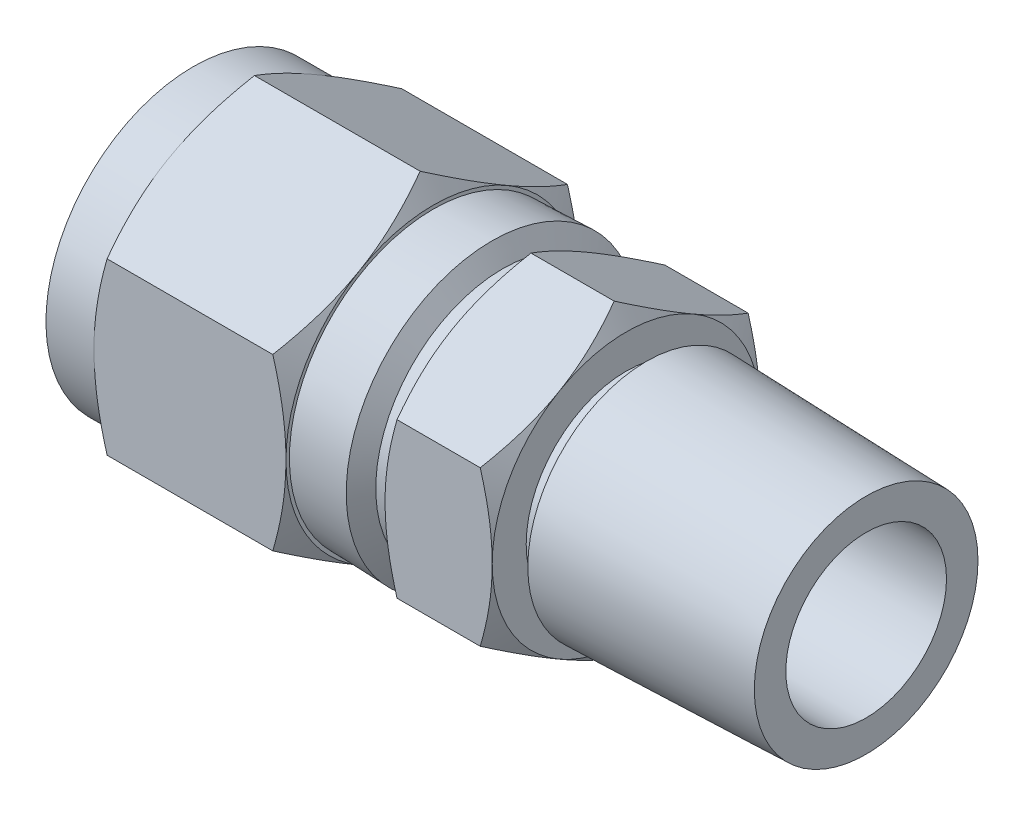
ISO-10303-21;
HEADER;
FILE_DESCRIPTION(('STEP AP214'),'2;1');
FILE_NAME('part.step','',(''),(''),'','','');
FILE_SCHEMA(('AUTOMOTIVE_DESIGN { 1 0 10303 214 1 1 1 1 }'));
ENDSEC;
DATA;
#1=APPLICATION_CONTEXT('core data for automotive mechanical design processes');
#2=APPLICATION_PROTOCOL_DEFINITION('international standard','automotive_design',2000,#1);
#3=PRODUCT_CONTEXT('',#1,'mechanical');
#4=PRODUCT('Part','Part','',(#3));
#5=PRODUCT_RELATED_PRODUCT_CATEGORY('part','',(#4));
#6=PRODUCT_DEFINITION_FORMATION('','',#4);
#7=PRODUCT_DEFINITION_CONTEXT('part definition',#1,'design');
#8=PRODUCT_DEFINITION('design','',#6,#7);
#9=PRODUCT_DEFINITION_SHAPE('','',#8);
#10=(LENGTH_UNIT() NAMED_UNIT(*) SI_UNIT(.MILLI.,.METRE.));
#11=(NAMED_UNIT(*) PLANE_ANGLE_UNIT() SI_UNIT($,.RADIAN.));
#12=(NAMED_UNIT(*) SI_UNIT($,.STERADIAN.) SOLID_ANGLE_UNIT());
#13=UNCERTAINTY_MEASURE_WITH_UNIT(LENGTH_MEASURE(1.E-05),#10,'distance_accuracy_value','');
#14=(GEOMETRIC_REPRESENTATION_CONTEXT(3) GLOBAL_UNCERTAINTY_ASSIGNED_CONTEXT((#13)) GLOBAL_UNIT_ASSIGNED_CONTEXT((#10,
#11,#12)) REPRESENTATION_CONTEXT('',''));
#15=CARTESIAN_POINT('',(0.,0.,0.));
#16=DIRECTION('',(0.,0.,1.));
#17=DIRECTION('',(1.,0.,0.));
#18=AXIS2_PLACEMENT_3D('',#15,#16,#17);
#19=CARTESIAN_POINT('',(-37.0332,0.,0.));
#20=DIRECTION('',(1.,0.,0.));
#21=DIRECTION('',(0.,0.,-1.));
#22=AXIS2_PLACEMENT_3D('',#19,#20,#21);
#23=CYLINDRICAL_SURFACE('',#22,4.50849999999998);
#24=CARTESIAN_POINT('',(-7.53618,0.,0.));
#25=DIRECTION('',(1.,0.,0.));
#26=DIRECTION('',(0.,0.,-1.));
#27=AXIS2_PLACEMENT_3D('',#24,#25,#26);
#28=CIRCLE('',#27,4.50849999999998);
#29=CARTESIAN_POINT('',(-7.53618,0.,-4.50849999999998));
#30=VERTEX_POINT('',#29);
#31=EDGE_CURVE('E256',#30,#30,#28,.T.);
#32=ORIENTED_EDGE('',*,*,#31,.T.);
#33=EDGE_LOOP('',(#32));
#34=FACE_BOUND('',#33,.T.);
#35=CARTESIAN_POINT('',(-23.114,0.,0.));
#36=DIRECTION('',(-1.,0.,0.));
#37=DIRECTION('',(0.,0.,1.));
#38=AXIS2_PLACEMENT_3D('',#35,#36,#37);
#39=CIRCLE('',#38,4.50849999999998);
#40=CARTESIAN_POINT('',(-23.114,0.,4.50849999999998));
#41=VERTEX_POINT('',#40);
#42=EDGE_CURVE('E45',#41,#41,#39,.F.);
#43=ORIENTED_EDGE('',*,*,#42,.F.);
#44=EDGE_LOOP('',(#43));
#45=FACE_BOUND('',#44,.T.);
#46=ADVANCED_FACE('F40',(#34,#45),#23,.F.);
#47=CARTESIAN_POINT('',(-37.0332,-5.04098953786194,8.73125));
#48=DIRECTION('',(0.,-0.866025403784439,0.5));
#49=DIRECTION('',(0.,-0.5,-0.866025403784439));
#50=AXIS2_PLACEMENT_3D('',#47,#48,#49);
#51=PLANE('',#50);
#52=DIRECTION('',(1.,0.,0.));
#53=VECTOR('',#52,1.);
#54=CARTESIAN_POINT('',(-37.0332,-10.0819790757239,0.));
#55=LINE('',#54,#53);
#56=CARTESIAN_POINT('',(-36.2533562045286,-10.0819790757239,0.));
#57=VERTEX_POINT('',#56);
#58=CARTESIAN_POINT('',(-26.4338437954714,-10.0819790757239,0.));
#59=VERTEX_POINT('',#58);
#60=EDGE_CURVE('E586',#57,#59,#55,.T.);
#61=ORIENTED_EDGE('',*,*,#60,.T.);
#62=CARTESIAN_POINT('',(-26.4339104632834,-10.0820945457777,-0.0002));
#63=CARTESIAN_POINT('',(-26.3699465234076,-9.97128814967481,0.191722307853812));
#64=CARTESIAN_POINT('',(-26.308885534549,-9.86006862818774,0.384360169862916));
#65=CARTESIAN_POINT('',(-26.1933690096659,-9.63672633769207,0.771200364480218));
#66=CARTESIAN_POINT('',(-26.1389163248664,-9.52460320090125,0.965403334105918));
#67=CARTESIAN_POINT('',(-25.9865396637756,-9.1864385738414,1.55112164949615));
#68=CARTESIAN_POINT('',(-25.8998698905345,-8.95906220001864,1.94494908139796));
#69=CARTESIAN_POINT('',(-25.7982395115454,-8.61879785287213,2.53430421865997));
#70=CARTESIAN_POINT('',(-25.76928798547,-8.50692640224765,2.728071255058));
#71=CARTESIAN_POINT('',(-25.7207412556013,-8.28267758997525,3.11648159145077));
#72=CARTESIAN_POINT('',(-25.7011452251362,-8.1703002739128,3.31112481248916));
#73=CARTESIAN_POINT('',(-25.6718061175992,-7.9453521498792,3.70074639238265));
#74=CARTESIAN_POINT('',(-25.6620518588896,-7.83278170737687,3.8957241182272));
#75=CARTESIAN_POINT('',(-25.6526054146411,-7.60753683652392,4.2858596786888));
#76=CARTESIAN_POINT('',(-25.6529129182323,-7.49486241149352,4.48101750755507));
#77=CARTESIAN_POINT('',(-25.6628900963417,-7.28421402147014,4.84587122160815));
#78=CARTESIAN_POINT('',(-25.6713426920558,-7.18622519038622,5.01559285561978));
#79=CARTESIAN_POINT('',(-25.6956937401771,-6.99047702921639,5.3546386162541));
#80=CARTESIAN_POINT('',(-25.7115926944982,-6.89271771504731,5.52396271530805));
#81=CARTESIAN_POINT('',(-25.770083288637,-6.59981823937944,6.03127948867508));
#82=CARTESIAN_POINT('',(-25.8234613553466,-6.40519653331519,6.36837417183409));
#83=CARTESIAN_POINT('',(-25.9569072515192,-6.01388862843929,7.04613934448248));
#84=CARTESIAN_POINT('',(-26.0375407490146,-5.81725236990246,7.38672333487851));
#85=CARTESIAN_POINT('',(-26.2205453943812,-5.42691219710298,8.06281234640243));
#86=CARTESIAN_POINT('',(-26.3228735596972,-5.23320328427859,8.3983260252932));
#87=CARTESIAN_POINT('',(-26.4339104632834,-5.04087406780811,8.73145));
#88=B_SPLINE_CURVE_WITH_KNOTS('',3,(#62,#63,#64,#65,#66,#67,#68,#69,#70,#71,#72,#73,#74,#75,#76,
#77,#78,#79,#80,#81,#82,#83,#84,#85,#86,#87),.UNSPECIFIED.,.F.,.F.,(4,2,2,2,2,2,2,2,2,2,2,2,4),
(0.,0.691921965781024,1.38414141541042,2.77145639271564,3.44812359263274,4.12473098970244,
4.80056879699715,5.47638572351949,6.06471866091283,6.65309125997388,7.8306745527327,
9.03437415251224,10.2357108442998),.UNSPECIFIED.);
#89=CARTESIAN_POINT('',(-25.654,-7.56148430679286,4.36562499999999));
#90=VERTEX_POINT('',#89);
#91=EDGE_CURVE('E65',#59,#90,#88,.T.);
#92=ORIENTED_EDGE('',*,*,#91,.T.);
#93=CARTESIAN_POINT('',(-26.4338437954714,-5.04098953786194,8.73125));
#94=VERTEX_POINT('',#93);
#95=EDGE_CURVE('E487',#90,#94,#88,.T.);
#96=ORIENTED_EDGE('',*,*,#95,.T.);
#97=DIRECTION('',(1.,0.,0.));
#98=VECTOR('',#97,1.);
#99=CARTESIAN_POINT('',(-37.0332,-5.04098953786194,8.73125));
#100=LINE('',#99,#98);
#101=CARTESIAN_POINT('',(-36.2533562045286,-5.04098953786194,8.73125));
#102=VERTEX_POINT('',#101);
#103=EDGE_CURVE('E600',#102,#94,#100,.T.);
#104=ORIENTED_EDGE('',*,*,#103,.F.);
#105=CARTESIAN_POINT('',(-36.2532895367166,-5.04087406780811,8.73145));
#106=CARTESIAN_POINT('',(-36.3172534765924,-5.151680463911,8.53952769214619));
#107=CARTESIAN_POINT('',(-36.378314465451,-5.26289998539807,8.34688983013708));
#108=CARTESIAN_POINT('',(-36.4938309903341,-5.48624227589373,7.96004963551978));
#109=CARTESIAN_POINT('',(-36.5482836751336,-5.59836541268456,7.76584666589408));
#110=CARTESIAN_POINT('',(-36.7006603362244,-5.9365300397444,7.18012835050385));
#111=CARTESIAN_POINT('',(-36.7873301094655,-6.16390641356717,6.78630091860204));
#112=CARTESIAN_POINT('',(-36.8889604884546,-6.50417076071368,6.19694578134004));
#113=CARTESIAN_POINT('',(-36.91791201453,-6.61604221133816,6.003178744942));
#114=CARTESIAN_POINT('',(-36.9664587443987,-6.84029102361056,5.61476840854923));
#115=CARTESIAN_POINT('',(-36.9860547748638,-6.95266833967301,5.42012518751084));
#116=CARTESIAN_POINT('',(-37.0153938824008,-7.1776164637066,5.03050360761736));
#117=CARTESIAN_POINT('',(-37.0251481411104,-7.29018690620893,4.83552588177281));
#118=CARTESIAN_POINT('',(-37.0345945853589,-7.51543177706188,4.4453903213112));
#119=CARTESIAN_POINT('',(-37.0342870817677,-7.62810620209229,4.25023249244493));
#120=CARTESIAN_POINT('',(-37.0243099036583,-7.83875459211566,3.88537877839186));
#121=CARTESIAN_POINT('',(-37.0158573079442,-7.93674342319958,3.71565714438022));
#122=CARTESIAN_POINT('',(-36.9915062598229,-8.13249158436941,3.3766113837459));
#123=CARTESIAN_POINT('',(-36.9756073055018,-8.2302508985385,3.20728728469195));
#124=CARTESIAN_POINT('',(-36.917116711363,-8.52315037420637,2.69997051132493));
#125=CARTESIAN_POINT('',(-36.8637386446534,-8.71777208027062,2.36287582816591));
#126=CARTESIAN_POINT('',(-36.7302927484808,-9.10907998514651,1.68511065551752));
#127=CARTESIAN_POINT('',(-36.6496592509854,-9.30571624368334,1.34452666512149));
#128=CARTESIAN_POINT('',(-36.4666546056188,-9.69605641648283,0.668437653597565));
#129=CARTESIAN_POINT('',(-36.3643264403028,-9.88976532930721,0.332923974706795));
#130=CARTESIAN_POINT('',(-36.2532895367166,-10.0820945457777,-0.000200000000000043));
#131=B_SPLINE_CURVE_WITH_KNOTS('',3,(#105,#106,#107,#108,#109,#110,#111,#112,#113,#114,#115,
#116,#117,#118,#119,#120,#121,#122,#123,#124,#125,#126,#127,#128,#129,#130),.UNSPECIFIED.,.F.,
.F.,(4,2,2,2,2,2,2,2,2,2,2,2,4),(0.,0.69192196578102,1.38414141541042,2.77145639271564,
3.44812359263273,4.12473098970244,4.80056879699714,5.47638572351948,6.06471866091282,
6.65309125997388,7.8306745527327,9.03437415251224,10.2357108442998),.UNSPECIFIED.);
#132=CARTESIAN_POINT('',(-37.0332,-7.56148430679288,4.365625));
#133=VERTEX_POINT('',#132);
#134=EDGE_CURVE('E553',#102,#133,#131,.T.);
#135=ORIENTED_EDGE('',*,*,#134,.T.);
#136=EDGE_CURVE('E546',#133,#57,#131,.T.);
#137=ORIENTED_EDGE('',*,*,#136,.T.);
#138=EDGE_LOOP('',(#61,#92,#96,#104,#135,#137));
#139=FACE_BOUND('',#138,.T.);
#140=ADVANCED_FACE('F42',(#139),#51,.T.);
#141=CARTESIAN_POINT('',(-37.0332,5.0409895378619,8.73124999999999));
#142=DIRECTION('',(0.,0.,1.));
#143=DIRECTION('',(0.,-1.,0.));
#144=AXIS2_PLACEMENT_3D('',#141,#142,#143);
#145=PLANE('',#144);
#146=ORIENTED_EDGE('',*,*,#103,.T.);
#147=CARTESIAN_POINT('',(-29.9947079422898,-13.7045253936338,8.73125));
#148=CARTESIAN_POINT('',(-29.8083603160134,-13.3217201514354,8.73125));
#149=CARTESIAN_POINT('',(-29.6237528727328,-12.9380534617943,8.73125));
#150=CARTESIAN_POINT('',(-29.2589940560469,-12.1685395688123,8.73125));
#151=CARTESIAN_POINT('',(-29.0788433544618,-11.7826920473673,8.73125));
#152=CARTESIAN_POINT('',(-28.7231024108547,-11.006448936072,8.73125));
#153=CARTESIAN_POINT('',(-28.5475409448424,-10.6160401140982,8.73125));
#154=CARTESIAN_POINT('',(-28.2033884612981,-9.8321735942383,8.73125));
#155=CARTESIAN_POINT('',(-28.0347971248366,-9.43871603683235,8.73125));
#156=CARTESIAN_POINT('',(-27.7009324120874,-8.63491429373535,8.73125));
#157=CARTESIAN_POINT('',(-27.5359581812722,-8.22444518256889,8.73125));
#158=CARTESIAN_POINT('',(-27.2181035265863,-7.39876691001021,8.73125));
#159=CARTESIAN_POINT('',(-27.0652244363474,-6.98355723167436,8.73125));
#160=CARTESIAN_POINT('',(-26.7754534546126,-6.14845728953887,8.73125));
#161=CARTESIAN_POINT('',(-26.6385305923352,-5.72857788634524,8.73125));
#162=CARTESIAN_POINT('',(-26.3849551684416,-4.88281332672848,8.73125));
#163=CARTESIAN_POINT('',(-26.2682963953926,-4.45693005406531,8.73125));
#164=CARTESIAN_POINT('',(-26.061360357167,-3.60118936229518,8.73125));
#165=CARTESIAN_POINT('',(-25.970937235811,-3.17136817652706,8.73125));
#166=CARTESIAN_POINT('',(-25.8588203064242,-2.52259506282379,8.73125));
#167=CARTESIAN_POINT('',(-25.8253661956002,-2.30564940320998,8.73125));
#168=CARTESIAN_POINT('',(-25.7669490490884,-1.87062496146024,8.73125));
#169=CARTESIAN_POINT('',(-25.741985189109,-1.65254629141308,8.73125));
#170=CARTESIAN_POINT('',(-25.7013679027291,-1.21846955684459,8.73125));
#171=CARTESIAN_POINT('',(-25.6855941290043,-1.00248280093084,8.73125));
#172=CARTESIAN_POINT('',(-25.6632017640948,-0.570035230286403,8.73125));
#173=CARTESIAN_POINT('',(-25.6565830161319,-0.353574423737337,8.73125));
#174=CARTESIAN_POINT('',(-25.652659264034,0.0794348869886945,8.73125));
#175=CARTESIAN_POINT('',(-25.6553543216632,0.295983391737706,8.73125));
#176=CARTESIAN_POINT('',(-25.6699904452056,0.728770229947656,8.73125));
#177=CARTESIAN_POINT('',(-25.6819319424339,0.945008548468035,8.73125));
#178=CARTESIAN_POINT('',(-25.7211042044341,1.45971828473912,8.73125));
#179=CARTESIAN_POINT('',(-25.7524450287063,1.75788395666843,8.73125));
#180=CARTESIAN_POINT('',(-25.8310343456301,2.35209541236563,8.73125));
#181=CARTESIAN_POINT('',(-25.8782848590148,2.64814092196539,8.73124999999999));
#182=CARTESIAN_POINT('',(-26.0414029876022,3.53269799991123,8.73124999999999));
#183=CARTESIAN_POINT('',(-26.1786113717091,4.11733148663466,8.73124999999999));
#184=CARTESIAN_POINT('',(-26.4177774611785,4.99192636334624,8.73124999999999));
#185=CARTESIAN_POINT('',(-26.5042360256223,5.28638772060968,8.73124999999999));
#186=CARTESIAN_POINT('',(-26.6864359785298,5.87245272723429,8.73124999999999));
#187=CARTESIAN_POINT('',(-26.7821774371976,6.1640563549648,8.73124999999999));
#188=CARTESIAN_POINT('',(-26.9813818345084,6.7444949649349,8.73124999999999));
#189=CARTESIAN_POINT('',(-27.0848425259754,7.03333072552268,8.73124999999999));
#190=CARTESIAN_POINT('',(-27.2982377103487,7.60858591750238,8.73124999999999));
#191=CARTESIAN_POINT('',(-27.4081720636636,7.89500540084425,8.73124999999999));
#192=CARTESIAN_POINT('',(-27.7085797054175,8.6560627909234,8.73124999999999));
#193=CARTESIAN_POINT('',(-27.9038585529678,9.12880189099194,8.73124999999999));
#194=CARTESIAN_POINT('',(-28.3056403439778,10.0695035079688,8.73124999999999));
#195=CARTESIAN_POINT('',(-28.5121444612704,10.5374655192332,8.73124999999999));
#196=CARTESIAN_POINT('',(-28.9337589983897,11.4696892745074,8.73124999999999));
#197=CARTESIAN_POINT('',(-29.1488725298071,11.9339496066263,8.73124999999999));
#198=CARTESIAN_POINT('',(-29.5856776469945,12.8593334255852,8.73124999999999));
#199=CARTESIAN_POINT('',(-29.8073689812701,13.3204570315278,8.73124999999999));
#200=CARTESIAN_POINT('',(-30.2562635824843,14.2408914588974,8.73124999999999));
#201=CARTESIAN_POINT('',(-30.4834748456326,14.7001983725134,8.73124999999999));
#202=CARTESIAN_POINT('',(-30.9420204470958,15.6167504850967,8.73124999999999));
#203=CARTESIAN_POINT('',(-31.1733548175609,16.0739956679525,8.73124999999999));
#204=CARTESIAN_POINT('',(-31.6392974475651,16.9866917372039,8.73124999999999));
#205=CARTESIAN_POINT('',(-31.8739050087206,17.4421429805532,8.73124999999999));
#206=CARTESIAN_POINT('',(-32.3458365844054,18.3516367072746,8.73124999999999));
#207=CARTESIAN_POINT('',(-32.58316060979,18.8056791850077,8.73124999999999));
#208=CARTESIAN_POINT('',(-33.2491057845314,20.0721484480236,8.73124999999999));
#209=CARTESIAN_POINT('',(-33.6801978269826,20.8832757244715,8.73124999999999));
#210=CARTESIAN_POINT('',(-34.5476083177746,22.5027855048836,8.73124999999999));
#211=CARTESIAN_POINT('',(-34.9839270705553,23.3111678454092,8.73124999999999));
#212=CARTESIAN_POINT('',(-35.8590452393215,24.9231821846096,8.73124999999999));
#213=CARTESIAN_POINT('',(-36.297831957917,25.7268210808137,8.73124999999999));
#214=CARTESIAN_POINT('',(-36.9582333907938,26.9310204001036,8.73124999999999));
#215=CARTESIAN_POINT('',(-37.1787291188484,27.3321953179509,8.73124999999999));
#216=CARTESIAN_POINT('',(-37.6203841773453,28.1341790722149,8.73124999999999));
#217=CARTESIAN_POINT('',(-37.8415435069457,28.5349879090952,8.73124999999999));
#218=CARTESIAN_POINT('',(-38.0629937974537,28.9356359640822,8.73124999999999));
#219=B_SPLINE_CURVE_WITH_KNOTS('',3,(#147,#148,#149,#150,#151,#152,#153,#154,#155,#156,#157,
#158,#159,#160,#161,#162,#163,#164,#165,#166,#167,#168,#169,#170,#171,#172,#173,#174,#175,#176,
#177,#178,#179,#180,#181,#182,#183,#184,#185,#186,#187,#188,#189,#190,#191,#192,#193,#194,#195,
#196,#197,#198,#199,#200,#201,#202,#203,#204,#205,#206,#207,#208,#209,#210,#211,#212,#213,#214,
#215,#216,#217,#218),.UNSPECIFIED.,.F.,.F.,(4,2,2,2,2,2,2,2,2,2,2,2,2,2,2,2,2,2,2,2,2,2,2,2,2,2,
2,2,2,2,2,2,2,2,2,4),(0.,1.27727267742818,2.55473673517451,3.83888136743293,5.12296717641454,
6.44996362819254,7.77710619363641,9.10162830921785,10.4257437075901,11.7423501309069,
12.4007399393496,13.0590658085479,13.7085647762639,14.3580526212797,15.0075447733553,
15.6570672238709,16.5559878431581,17.4550226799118,19.2539875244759,20.1745814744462,
21.0951823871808,22.0155163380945,22.9358304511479,24.4700682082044,26.0044667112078,
27.5394248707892,29.0743244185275,30.6115983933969,32.1488843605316,33.6858471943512,
35.2228161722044,37.9784915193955,40.7343281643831,43.4811945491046,44.8545247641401,
46.2278532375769),.UNSPECIFIED.);
#220=CARTESIAN_POINT('',(-25.654,0.,8.73124999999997));
#221=VERTEX_POINT('',#220);
#222=EDGE_CURVE('E479',#94,#221,#219,.T.);
#223=ORIENTED_EDGE('',*,*,#222,.T.);
#224=CARTESIAN_POINT('',(-26.4338437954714,5.0409895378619,8.73124999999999));
#225=VERTEX_POINT('',#224);
#226=EDGE_CURVE('E471',#221,#225,#219,.T.);
#227=ORIENTED_EDGE('',*,*,#226,.T.);
#228=DIRECTION('',(1.,0.,0.));
#229=VECTOR('',#228,1.);
#230=CARTESIAN_POINT('',(-37.0332,5.0409895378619,8.73124999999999));
#231=LINE('',#230,#229);
#232=CARTESIAN_POINT('',(-36.2533562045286,5.0409895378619,8.73124999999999));
#233=VERTEX_POINT('',#232);
#234=EDGE_CURVE('E637',#233,#225,#231,.T.);
#235=ORIENTED_EDGE('',*,*,#234,.F.);
#236=CARTESIAN_POINT('',(-32.8049784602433,-13.4729393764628,8.73125));
#237=CARTESIAN_POINT('',(-32.9894186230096,-13.0921567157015,8.73125));
#238=CARTESIAN_POINT('',(-33.1720705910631,-12.7104926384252,8.73125));
#239=CARTESIAN_POINT('',(-33.5327910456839,-11.9449326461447,8.73125));
#240=CARTESIAN_POINT('',(-33.7108587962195,-11.5610363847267,8.73125));
#241=CARTESIAN_POINT('',(-34.0623141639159,-10.7885322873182,8.73125));
#242=CARTESIAN_POINT('',(-34.2356704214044,-10.3999101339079,8.73125));
#243=CARTESIAN_POINT('',(-34.5751975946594,-9.61955115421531,8.73125));
#244=CARTESIAN_POINT('',(-34.7413688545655,-9.22781447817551,8.73125));
#245=CARTESIAN_POINT('',(-35.0697151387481,-8.42821178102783,8.73125));
#246=CARTESIAN_POINT('',(-35.2316000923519,-8.02022597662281,8.73125));
#247=CARTESIAN_POINT('',(-35.5429530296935,-7.19945718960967,8.73125));
#248=CARTESIAN_POINT('',(-35.6924196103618,-6.78667367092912,8.73125));
#249=CARTESIAN_POINT('',(-35.9749616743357,-5.95644258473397,8.73125));
#250=CARTESIAN_POINT('',(-36.1080709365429,-5.53900663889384,8.73125));
#251=CARTESIAN_POINT('',(-36.3535843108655,-4.69816266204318,8.73125));
#252=CARTESIAN_POINT('',(-36.4659950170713,-4.27475657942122,8.73125));
#253=CARTESIAN_POINT('',(-36.6640688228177,-3.42400399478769,8.73125));
#254=CARTESIAN_POINT('',(-36.7498747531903,-2.99669167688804,8.73125));
#255=CARTESIAN_POINT('',(-36.854882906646,-2.35188672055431,8.73125));
#256=CARTESIAN_POINT('',(-36.8859369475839,-2.13629593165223,8.73125));
#257=CARTESIAN_POINT('',(-36.9395341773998,-1.70406595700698,8.73125));
#258=CARTESIAN_POINT('',(-36.9620781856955,-1.48742687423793,8.73125));
#259=CARTESIAN_POINT('',(-36.9979270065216,-1.05619033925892,8.73125));
#260=CARTESIAN_POINT('',(-37.0113470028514,-0.841602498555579,8.73125));
#261=CARTESIAN_POINT('',(-37.0291052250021,-0.412051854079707,8.73125));
#262=CARTESIAN_POINT('',(-37.0334435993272,-0.197089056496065,8.73125));
#263=CARTESIAN_POINT('',(-37.0329352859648,0.23282796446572,8.73125));
#264=CARTESIAN_POINT('',(-37.0280885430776,0.447782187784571,8.73125));
#265=CARTESIAN_POINT('',(-37.0093271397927,0.877297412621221,8.73125));
#266=CARTESIAN_POINT('',(-36.9954120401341,1.09185839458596,8.73125));
#267=CARTESIAN_POINT('',(-36.9511859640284,1.60959681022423,8.73125));
#268=CARTESIAN_POINT('',(-36.916456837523,1.91240331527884,8.73125));
#269=CARTESIAN_POINT('',(-36.8308448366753,2.51572576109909,8.73125));
#270=CARTESIAN_POINT('',(-36.7799597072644,2.81624137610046,8.73124999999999));
#271=CARTESIAN_POINT('',(-36.6638460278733,3.41471080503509,8.73124999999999));
#272=CARTESIAN_POINT('',(-36.5986060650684,3.71266238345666,8.73124999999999));
#273=CARTESIAN_POINT('',(-36.455769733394,4.30555561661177,8.73124999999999));
#274=CARTESIAN_POINT('',(-36.3781735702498,4.60049732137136,8.73124999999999));
#275=CARTESIAN_POINT('',(-36.2106928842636,5.19379294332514,8.73124999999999));
#276=CARTESIAN_POINT('',(-36.1205775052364,5.49208124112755,8.73124999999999));
#277=CARTESIAN_POINT('',(-35.9311855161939,6.08571879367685,8.73124999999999));
#278=CARTESIAN_POINT('',(-35.8319088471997,6.381068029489,8.73124999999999));
#279=CARTESIAN_POINT('',(-35.6257573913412,6.96897581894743,8.73124999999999));
#280=CARTESIAN_POINT('',(-35.5188852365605,7.26153529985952,8.73124999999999));
#281=CARTESIAN_POINT('',(-35.2987853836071,7.84424033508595,8.73124999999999));
#282=CARTESIAN_POINT('',(-35.1855577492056,8.13438591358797,8.73124999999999));
#283=CARTESIAN_POINT('',(-34.918024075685,8.80179577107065,8.73124999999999));
#284=CARTESIAN_POINT('',(-34.7618281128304,9.17830117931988,8.73124999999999));
#285=CARTESIAN_POINT('',(-34.4422205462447,9.92824556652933,8.73124999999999));
#286=CARTESIAN_POINT('',(-34.2788085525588,10.301684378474,8.73124999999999));
#287=CARTESIAN_POINT('',(-33.9461663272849,11.0460437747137,8.73124999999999));
#288=CARTESIAN_POINT('',(-33.7769349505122,11.4169638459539,8.73124999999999));
#289=CARTESIAN_POINT('',(-33.4337875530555,12.1566172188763,8.73124999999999));
#290=CARTESIAN_POINT('',(-33.259871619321,12.5253505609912,8.73124999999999));
#291=CARTESIAN_POINT('',(-32.9080292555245,13.261349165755,8.73124999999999));
#292=CARTESIAN_POINT('',(-32.7300989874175,13.628612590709,8.73124999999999));
#293=CARTESIAN_POINT('',(-32.3710584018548,14.361583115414,8.73124999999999));
#294=CARTESIAN_POINT('',(-32.1899480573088,14.727290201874,8.73124999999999));
#295=CARTESIAN_POINT('',(-31.6427111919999,15.8223502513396,8.73124999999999));
#296=CARTESIAN_POINT('',(-31.2726364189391,16.5497300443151,8.73124999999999));
#297=CARTESIAN_POINT('',(-30.5549064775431,17.9426032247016,8.73124999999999));
#298=CARTESIAN_POINT('',(-30.2078252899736,18.6083936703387,8.73124999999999));
#299=CARTESIAN_POINT('',(-29.5088610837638,19.9374740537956,8.73124999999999));
#300=CARTESIAN_POINT('',(-29.1569779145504,20.6007639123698,8.73124999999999));
#301=CARTESIAN_POINT('',(-28.4503548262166,21.9238467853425,8.73124999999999));
#302=CARTESIAN_POINT('',(-28.0956233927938,22.5836443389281,8.73124999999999));
#303=CARTESIAN_POINT('',(-27.3832619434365,23.9016297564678,8.73124999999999));
#304=CARTESIAN_POINT('',(-27.0256320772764,24.5598177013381,8.73124999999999));
#305=CARTESIAN_POINT('',(-26.6669142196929,25.2174081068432,8.73124999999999));
#306=B_SPLINE_CURVE_WITH_KNOTS('',3,(#236,#237,#238,#239,#240,#241,#242,#243,#244,#245,#246,
#247,#248,#249,#250,#251,#252,#253,#254,#255,#256,#257,#258,#259,#260,#261,#262,#263,#264,#265,
#266,#267,#268,#269,#270,#271,#272,#273,#274,#275,#276,#277,#278,#279,#280,#281,#282,#283,#284,
#285,#286,#287,#288,#289,#290,#291,#292,#293,#294,#295,#296,#297,#298,#299,#300,#301,#302,#303,
#304,#305),.UNSPECIFIED.,.F.,.F.,(4,2,2,2,2,2,2,2,2,2,2,2,2,2,2,2,2,2,2,2,2,2,2,2,2,2,2,2,2,2,2,
2,2,2,4),(0.,1.26931582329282,2.53883418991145,3.81537930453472,5.09186320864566,
6.40849506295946,7.72527547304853,9.03928924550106,10.3528836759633,11.6592986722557,
12.3126046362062,12.9658476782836,13.6106827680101,14.2555073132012,14.9003357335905,
15.5451953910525,16.4590628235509,17.3730578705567,18.2877822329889,19.2024913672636,
20.1371254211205,21.0717654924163,22.0060832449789,22.9403916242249,24.1631493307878,
25.3859731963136,26.6090390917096,27.8320823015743,29.0563490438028,30.2806262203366,
32.7288874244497,34.981349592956,37.2338825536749,39.4812076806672,41.7284174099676),.UNSPECIFIED.);
#307=CARTESIAN_POINT('',(-37.0332,0.,8.73125));
#308=VERTEX_POINT('',#307);
#309=EDGE_CURVE('E660',#233,#308,#306,.F.);
#310=ORIENTED_EDGE('',*,*,#309,.T.);
#311=EDGE_CURVE('E463',#308,#102,#306,.F.);
#312=ORIENTED_EDGE('',*,*,#311,.T.);
#313=EDGE_LOOP('',(#146,#223,#227,#235,#310,#312));
#314=FACE_BOUND('',#313,.T.);
#315=ADVANCED_FACE('F441',(#314),#145,.T.);
#316=CARTESIAN_POINT('',(-37.0332,10.0819790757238,0.));
#317=DIRECTION('',(0.,0.866025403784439,0.5));
#318=DIRECTION('',(0.,-0.5,0.866025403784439));
#319=AXIS2_PLACEMENT_3D('',#316,#317,#318);
#320=PLANE('',#319);
#321=ORIENTED_EDGE('',*,*,#234,.T.);
#322=CARTESIAN_POINT('',(-26.4339104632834,5.04087406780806,8.73145));
#323=CARTESIAN_POINT('',(-26.3699465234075,5.15168046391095,8.53952769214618));
#324=CARTESIAN_POINT('',(-26.308885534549,5.26289998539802,8.34688983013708));
#325=CARTESIAN_POINT('',(-26.1933690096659,5.48624227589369,7.96004963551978));
#326=CARTESIAN_POINT('',(-26.1389163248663,5.59836541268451,7.76584666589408));
#327=CARTESIAN_POINT('',(-25.9865396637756,5.93653003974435,7.18012835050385));
#328=CARTESIAN_POINT('',(-25.8998698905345,6.16390641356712,6.78630091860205));
#329=CARTESIAN_POINT('',(-25.7982395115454,6.50417076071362,6.19694578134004));
#330=CARTESIAN_POINT('',(-25.76928798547,6.6160422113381,6.00317874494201));
#331=CARTESIAN_POINT('',(-25.7207412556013,6.8402910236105,5.61476840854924));
#332=CARTESIAN_POINT('',(-25.7011452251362,6.95266833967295,5.42012518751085));
#333=CARTESIAN_POINT('',(-25.6718061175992,7.17761646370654,5.03050360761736));
#334=CARTESIAN_POINT('',(-25.6620518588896,7.29018690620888,4.83552588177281));
#335=CARTESIAN_POINT('',(-25.652605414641,7.51543177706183,4.44539032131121));
#336=CARTESIAN_POINT('',(-25.6529129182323,7.62810620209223,4.25023249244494));
#337=CARTESIAN_POINT('',(-25.6628900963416,7.83875459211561,3.88537877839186));
#338=CARTESIAN_POINT('',(-25.6713426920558,7.93674342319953,3.71565714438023));
#339=CARTESIAN_POINT('',(-25.6956937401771,8.13249158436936,3.37661138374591));
#340=CARTESIAN_POINT('',(-25.7115926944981,8.23025089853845,3.20728728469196));
#341=CARTESIAN_POINT('',(-25.7700832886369,8.52315037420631,2.69997051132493));
#342=CARTESIAN_POINT('',(-25.8234613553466,8.71777208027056,2.36287582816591));
#343=CARTESIAN_POINT('',(-25.9569072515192,9.10907998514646,1.68511065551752));
#344=CARTESIAN_POINT('',(-26.0375407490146,9.30571624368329,1.34452666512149));
#345=CARTESIAN_POINT('',(-26.2205453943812,9.69605641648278,0.668437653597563));
#346=CARTESIAN_POINT('',(-26.3228735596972,9.88976532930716,0.332923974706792));
#347=CARTESIAN_POINT('',(-26.4339104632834,10.0820945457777,-0.000200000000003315));
#348=B_SPLINE_CURVE_WITH_KNOTS('',3,(#322,#323,#324,#325,#326,#327,#328,#329,#330,#331,#332,
#333,#334,#335,#336,#337,#338,#339,#340,#341,#342,#343,#344,#345,#346,#347),.UNSPECIFIED.,.F.,
.F.,(4,2,2,2,2,2,2,2,2,2,2,2,4),(0.,0.691921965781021,1.38414141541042,2.77145639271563,
3.44812359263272,4.12473098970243,4.80056879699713,5.47638572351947,6.06471866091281,
6.65309125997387,7.83067455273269,9.03437415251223,10.2357108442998),.UNSPECIFIED.);
#349=CARTESIAN_POINT('',(-25.654,7.56148430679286,4.36562499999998));
#350=VERTEX_POINT('',#349);
#351=EDGE_CURVE('E480',#225,#350,#348,.T.);
#352=ORIENTED_EDGE('',*,*,#351,.T.);
#353=CARTESIAN_POINT('',(-26.4338437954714,10.0819790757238,0.));
#354=VERTEX_POINT('',#353);
#355=EDGE_CURVE('E481',#350,#354,#348,.T.);
#356=ORIENTED_EDGE('',*,*,#355,.T.);
#357=DIRECTION('',(1.,0.,0.));
#358=VECTOR('',#357,1.);
#359=CARTESIAN_POINT('',(-37.0332,10.0819790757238,0.));
#360=LINE('',#359,#358);
#361=CARTESIAN_POINT('',(-36.2533562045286,10.0819790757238,0.));
#362=VERTEX_POINT('',#361);
#363=EDGE_CURVE('E589',#362,#354,#360,.T.);
#364=ORIENTED_EDGE('',*,*,#363,.F.);
#365=CARTESIAN_POINT('',(-36.2532895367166,10.0820945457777,-0.000200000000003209));
#366=CARTESIAN_POINT('',(-36.3172534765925,9.97128814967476,0.191722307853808));
#367=CARTESIAN_POINT('',(-36.378314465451,9.86006862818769,0.384360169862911));
#368=CARTESIAN_POINT('',(-36.4938309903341,9.63672633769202,0.771200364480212));
#369=CARTESIAN_POINT('',(-36.5482836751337,9.5246032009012,0.965403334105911));
#370=CARTESIAN_POINT('',(-36.7006603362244,9.18643857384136,1.55112164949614));
#371=CARTESIAN_POINT('',(-36.7873301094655,8.95906220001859,1.94494908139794));
#372=CARTESIAN_POINT('',(-36.8889604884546,8.61879785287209,2.53430421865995));
#373=CARTESIAN_POINT('',(-36.91791201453,8.50692640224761,2.72807125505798));
#374=CARTESIAN_POINT('',(-36.9664587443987,8.28267758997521,3.11648159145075));
#375=CARTESIAN_POINT('',(-36.9860547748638,8.17030027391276,3.31112481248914));
#376=CARTESIAN_POINT('',(-37.0153938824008,7.94535214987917,3.70074639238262));
#377=CARTESIAN_POINT('',(-37.0251481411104,7.83278170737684,3.89572411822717));
#378=CARTESIAN_POINT('',(-37.034594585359,7.60753683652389,4.28585967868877));
#379=CARTESIAN_POINT('',(-37.0342870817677,7.49486241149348,4.48101750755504));
#380=CARTESIAN_POINT('',(-37.0243099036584,7.2842140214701,4.84587122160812));
#381=CARTESIAN_POINT('',(-37.0158573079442,7.18622519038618,5.01559285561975));
#382=CARTESIAN_POINT('',(-36.9915062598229,6.99047702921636,5.35463861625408));
#383=CARTESIAN_POINT('',(-36.9756073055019,6.89271771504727,5.52396271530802));
#384=CARTESIAN_POINT('',(-36.9171167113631,6.5998182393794,6.03127948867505));
#385=CARTESIAN_POINT('',(-36.8637386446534,6.40519653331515,6.36837417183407));
#386=CARTESIAN_POINT('',(-36.7302927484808,6.01388862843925,7.04613934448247));
#387=CARTESIAN_POINT('',(-36.6496592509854,5.81725236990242,7.3867233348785));
#388=CARTESIAN_POINT('',(-36.4666546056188,5.42691219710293,8.06281234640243));
#389=CARTESIAN_POINT('',(-36.3643264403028,5.23320328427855,8.3983260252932));
#390=CARTESIAN_POINT('',(-36.2532895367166,5.04087406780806,8.73145));
#391=B_SPLINE_CURVE_WITH_KNOTS('',3,(#365,#366,#367,#368,#369,#370,#371,#372,#373,#374,#375,
#376,#377,#378,#379,#380,#381,#382,#383,#384,#385,#386,#387,#388,#389,#390),.UNSPECIFIED.,.F.,
.F.,(4,2,2,2,2,2,2,2,2,2,2,2,4),(0.,0.69192196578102,1.38414141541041,2.77145639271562,
3.44812359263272,4.12473098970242,4.80056879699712,5.47638572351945,6.0647186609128,
6.65309125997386,7.83067455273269,9.03437415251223,10.2357108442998),.UNSPECIFIED.);
#392=CARTESIAN_POINT('',(-37.0332,7.56148430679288,4.365625));
#393=VERTEX_POINT('',#392);
#394=EDGE_CURVE('E592',#362,#393,#391,.T.);
#395=ORIENTED_EDGE('',*,*,#394,.T.);
#396=EDGE_CURVE('E658',#393,#233,#391,.T.);
#397=ORIENTED_EDGE('',*,*,#396,.T.);
#398=EDGE_LOOP('',(#321,#352,#356,#364,#395,#397));
#399=FACE_BOUND('',#398,.T.);
#400=ADVANCED_FACE('F457',(#399),#320,.T.);
#401=CARTESIAN_POINT('',(-37.0332,5.04098953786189,-8.73125));
#402=DIRECTION('',(0.,0.866025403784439,-0.5));
#403=DIRECTION('',(0.,0.5,0.866025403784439));
#404=AXIS2_PLACEMENT_3D('',#401,#402,#403);
#405=PLANE('',#404);
#406=ORIENTED_EDGE('',*,*,#363,.T.);
#407=CARTESIAN_POINT('',(-26.4339104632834,10.0820945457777,0.000199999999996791));
#408=CARTESIAN_POINT('',(-26.3699465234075,9.97128814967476,-0.191722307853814));
#409=CARTESIAN_POINT('',(-26.308885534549,9.86006862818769,-0.384360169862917));
#410=CARTESIAN_POINT('',(-26.1933690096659,9.63672633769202,-0.771200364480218));
#411=CARTESIAN_POINT('',(-26.1389163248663,9.5246032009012,-0.965403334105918));
#412=CARTESIAN_POINT('',(-25.9865396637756,9.18643857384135,-1.55112164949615));
#413=CARTESIAN_POINT('',(-25.8998698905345,8.95906220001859,-1.94494908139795));
#414=CARTESIAN_POINT('',(-25.7982395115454,8.61879785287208,-2.53430421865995));
#415=CARTESIAN_POINT('',(-25.76928798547,8.5069264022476,-2.72807125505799));
#416=CARTESIAN_POINT('',(-25.7207412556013,8.28267758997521,-3.11648159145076));
#417=CARTESIAN_POINT('',(-25.7011452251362,8.17030027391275,-3.31112481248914));
#418=CARTESIAN_POINT('',(-25.6718061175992,7.94535214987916,-3.70074639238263));
#419=CARTESIAN_POINT('',(-25.6620518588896,7.83278170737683,-3.89572411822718));
#420=CARTESIAN_POINT('',(-25.652605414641,7.60753683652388,-4.28585967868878));
#421=CARTESIAN_POINT('',(-25.6529129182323,7.49486241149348,-4.48101750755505));
#422=CARTESIAN_POINT('',(-25.6628900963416,7.2842140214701,-4.84587122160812));
#423=CARTESIAN_POINT('',(-25.6713426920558,7.18622519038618,-5.01559285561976));
#424=CARTESIAN_POINT('',(-25.6956937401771,6.99047702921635,-5.35463861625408));
#425=CARTESIAN_POINT('',(-25.7115926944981,6.89271771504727,-5.52396271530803));
#426=CARTESIAN_POINT('',(-25.7700832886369,6.5998182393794,-6.03127948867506));
#427=CARTESIAN_POINT('',(-25.8234613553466,6.40519653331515,-6.36837417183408));
#428=CARTESIAN_POINT('',(-25.9569072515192,6.01388862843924,-7.04613934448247));
#429=CARTESIAN_POINT('',(-26.0375407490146,5.81725236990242,-7.3867233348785));
#430=CARTESIAN_POINT('',(-26.2205453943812,5.42691219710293,-8.06281234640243));
#431=CARTESIAN_POINT('',(-26.3228735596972,5.23320328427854,-8.3983260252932));
#432=CARTESIAN_POINT('',(-26.4339104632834,5.04087406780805,-8.73145));
#433=B_SPLINE_CURVE_WITH_KNOTS('',3,(#407,#408,#409,#410,#411,#412,#413,#414,#415,#416,#417,
#418,#419,#420,#421,#422,#423,#424,#425,#426,#427,#428,#429,#430,#431,#432),.UNSPECIFIED.,.F.,
.F.,(4,2,2,2,2,2,2,2,2,2,2,2,4),(0.,0.691921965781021,1.38414141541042,2.77145639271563,
3.44812359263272,4.12473098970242,4.80056879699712,5.47638572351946,6.0647186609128,
6.65309125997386,7.83067455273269,9.03437415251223,10.2357108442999),.UNSPECIFIED.);
#434=CARTESIAN_POINT('',(-25.654,7.56148430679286,-4.36562499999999));
#435=VERTEX_POINT('',#434);
#436=EDGE_CURVE('E528',#354,#435,#433,.T.);
#437=ORIENTED_EDGE('',*,*,#436,.T.);
#438=CARTESIAN_POINT('',(-26.4338437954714,5.04098953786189,-8.73125));
#439=VERTEX_POINT('',#438);
#440=EDGE_CURVE('E522',#435,#439,#433,.T.);
#441=ORIENTED_EDGE('',*,*,#440,.T.);
#442=DIRECTION('',(1.,0.,0.));
#443=VECTOR('',#442,1.);
#444=CARTESIAN_POINT('',(-37.0332,5.04098953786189,-8.73125));
#445=LINE('',#444,#443);
#446=CARTESIAN_POINT('',(-36.2533562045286,5.04098953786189,-8.73125));
#447=VERTEX_POINT('',#446);
#448=EDGE_CURVE('E585',#447,#439,#445,.T.);
#449=ORIENTED_EDGE('',*,*,#448,.F.);
#450=CARTESIAN_POINT('',(-36.2532895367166,5.04087406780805,-8.73145));
#451=CARTESIAN_POINT('',(-36.3172534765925,5.15168046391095,-8.53952769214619));
#452=CARTESIAN_POINT('',(-36.378314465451,5.26289998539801,-8.34688983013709));
#453=CARTESIAN_POINT('',(-36.4938309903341,5.48624227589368,-7.96004963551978));
#454=CARTESIAN_POINT('',(-36.5482836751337,5.5983654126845,-7.76584666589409));
#455=CARTESIAN_POINT('',(-36.7006603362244,5.93653003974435,-7.18012835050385));
#456=CARTESIAN_POINT('',(-36.7873301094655,6.16390641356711,-6.78630091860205));
#457=CARTESIAN_POINT('',(-36.8889604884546,6.50417076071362,-6.19694578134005));
#458=CARTESIAN_POINT('',(-36.91791201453,6.6160422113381,-6.00317874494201));
#459=CARTESIAN_POINT('',(-36.9664587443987,6.8402910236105,-5.61476840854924));
#460=CARTESIAN_POINT('',(-36.9860547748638,6.95266833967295,-5.42012518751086));
#461=CARTESIAN_POINT('',(-37.0153938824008,7.17761646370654,-5.03050360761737));
#462=CARTESIAN_POINT('',(-37.0251481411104,7.29018690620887,-4.83552588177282));
#463=CARTESIAN_POINT('',(-37.034594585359,7.51543177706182,-4.44539032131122));
#464=CARTESIAN_POINT('',(-37.0342870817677,7.62810620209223,-4.25023249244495));
#465=CARTESIAN_POINT('',(-37.0243099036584,7.8387545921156,-3.88537877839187));
#466=CARTESIAN_POINT('',(-37.0158573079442,7.93674342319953,-3.71565714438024));
#467=CARTESIAN_POINT('',(-36.9915062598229,8.13249158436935,-3.37661138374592));
#468=CARTESIAN_POINT('',(-36.9756073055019,8.23025089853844,-3.20728728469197));
#469=CARTESIAN_POINT('',(-36.9171167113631,8.52315037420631,-2.69997051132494));
#470=CARTESIAN_POINT('',(-36.8637386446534,8.71777208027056,-2.36287582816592));
#471=CARTESIAN_POINT('',(-36.7302927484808,9.10907998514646,-1.68511065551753));
#472=CARTESIAN_POINT('',(-36.6496592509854,9.30571624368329,-1.3445266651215));
#473=CARTESIAN_POINT('',(-36.4666546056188,9.69605641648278,-0.66843765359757));
#474=CARTESIAN_POINT('',(-36.3643264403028,9.88976532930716,-0.332923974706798));
#475=CARTESIAN_POINT('',(-36.2532895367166,10.0820945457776,0.000199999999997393));
#476=B_SPLINE_CURVE_WITH_KNOTS('',3,(#450,#451,#452,#453,#454,#455,#456,#457,#458,#459,#460,
#461,#462,#463,#464,#465,#466,#467,#468,#469,#470,#471,#472,#473,#474,#475),.UNSPECIFIED.,.F.,
.F.,(4,2,2,2,2,2,2,2,2,2,2,2,4),(0.,0.691921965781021,1.38414141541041,2.77145639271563,
3.44812359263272,4.12473098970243,4.80056879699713,5.47638572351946,6.0647186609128,
6.65309125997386,7.83067455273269,9.03437415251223,10.2357108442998),.UNSPECIFIED.);
#477=CARTESIAN_POINT('',(-37.0332,7.56148430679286,-4.36562499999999));
#478=VERTEX_POINT('',#477);
#479=EDGE_CURVE('E537',#447,#478,#476,.T.);
#480=ORIENTED_EDGE('',*,*,#479,.T.);
#481=EDGE_CURVE('E545',#478,#362,#476,.T.);
#482=ORIENTED_EDGE('',*,*,#481,.T.);
#483=EDGE_LOOP('',(#406,#437,#441,#449,#480,#482));
#484=FACE_BOUND('',#483,.T.);
#485=ADVANCED_FACE('F530',(#484),#405,.T.);
#486=CARTESIAN_POINT('',(-37.0332,-5.04098953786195,-8.73125));
#487=DIRECTION('',(0.,0.,-1.));
#488=DIRECTION('',(0.,1.,0.));
#489=AXIS2_PLACEMENT_3D('',#486,#487,#488);
#490=PLANE('',#489);
#491=ORIENTED_EDGE('',*,*,#448,.T.);
#492=CARTESIAN_POINT('',(-29.994707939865,-13.704525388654,-8.73125));
#493=CARTESIAN_POINT('',(-29.8083603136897,-13.3217201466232,-8.73125));
#494=CARTESIAN_POINT('',(-29.6237528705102,-12.9380534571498,-8.73125));
#495=CARTESIAN_POINT('',(-29.258994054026,-12.1685395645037,-8.73125));
#496=CARTESIAN_POINT('',(-29.0788433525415,-11.782692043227,-8.73125));
#497=CARTESIAN_POINT('',(-28.7231024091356,-11.0064489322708,-8.73125));
#498=CARTESIAN_POINT('',(-28.5475409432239,-10.6160401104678,-8.73125));
#499=CARTESIAN_POINT('',(-28.2033884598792,-9.83217359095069,-8.73125));
#500=CARTESIAN_POINT('',(-28.0347971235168,-9.43871603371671,-8.73125));
#501=CARTESIAN_POINT('',(-27.7009324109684,-8.63491429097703,-8.73125));
#502=CARTESIAN_POINT('',(-27.5359581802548,-8.22444517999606,-8.73125));
#503=CARTESIAN_POINT('',(-27.2181035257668,-7.39876690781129,-8.73125));
#504=CARTESIAN_POINT('',(-27.0652244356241,-6.9835572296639,-8.73125));
#505=CARTESIAN_POINT('',(-26.7754534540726,-6.1484572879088,-8.73125));
#506=CARTESIAN_POINT('',(-26.6385305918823,-5.7285778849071,-8.73125));
#507=CARTESIAN_POINT('',(-26.3849551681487,-4.88281332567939,-8.73125));
#508=CARTESIAN_POINT('',(-26.2682963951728,-4.45693005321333,-8.73125));
#509=CARTESIAN_POINT('',(-26.0613603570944,-3.60118936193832,-8.73125));
#510=CARTESIAN_POINT('',(-25.9709372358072,-3.17136817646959,-8.73125));
#511=CARTESIAN_POINT('',(-25.8588203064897,-2.52259506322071,-8.73125));
#512=CARTESIAN_POINT('',(-25.8253661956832,-2.30564940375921,-8.73125));
#513=CARTESIAN_POINT('',(-25.7669490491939,-1.87062496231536,-8.73125));
#514=CARTESIAN_POINT('',(-25.7419851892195,-1.6525462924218,-8.73125));
#515=CARTESIAN_POINT('',(-25.701367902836,-1.21846955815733,-8.73125));
#516=CARTESIAN_POINT('',(-25.6855941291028,-1.00248280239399,-8.73125));
#517=CARTESIAN_POINT('',(-25.6632017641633,-0.570035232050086,-8.73125));
#518=CARTESIAN_POINT('',(-25.6565830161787,-0.353574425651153,-8.73125));
#519=CARTESIAN_POINT('',(-25.6526592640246,0.0794348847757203,-8.73125));
#520=CARTESIAN_POINT('',(-25.6553543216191,0.295983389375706,-8.73125));
#521=CARTESIAN_POINT('',(-25.66999044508,0.728770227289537,-8.73125));
#522=CARTESIAN_POINT('',(-25.6819319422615,0.945008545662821,-8.73125));
#523=CARTESIAN_POINT('',(-25.7211042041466,1.45971828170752,-8.73125));
#524=CARTESIAN_POINT('',(-25.7524450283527,1.75788395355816,-8.73125));
#525=CARTESIAN_POINT('',(-25.8310343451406,2.35209540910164,-8.73125));
#526=CARTESIAN_POINT('',(-25.8782848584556,2.64814091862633,-8.73125));
#527=CARTESIAN_POINT('',(-26.0414029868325,3.53269799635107,-8.73125));
#528=CARTESIAN_POINT('',(-26.1786113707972,4.11733148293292,-8.73125));
#529=CARTESIAN_POINT('',(-26.4177774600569,4.99192635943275,-8.73125));
#530=CARTESIAN_POINT('',(-26.5042360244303,5.28638771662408,-8.73125));
#531=CARTESIAN_POINT('',(-26.6864359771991,5.87245272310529,-8.73125));
#532=CARTESIAN_POINT('',(-26.7821774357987,6.16405635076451,-8.73125));
#533=CARTESIAN_POINT('',(-26.9813818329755,6.74449496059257,-8.73125));
#534=CARTESIAN_POINT('',(-27.0848425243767,7.03333072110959,-8.73125));
#535=CARTESIAN_POINT('',(-27.2982377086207,7.60858591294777,-8.73125));
#536=CARTESIAN_POINT('',(-27.4081720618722,7.89500539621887,-8.73125));
#537=CARTESIAN_POINT('',(-27.7085797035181,8.65606278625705,-8.73125));
#538=CARTESIAN_POINT('',(-27.9038585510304,9.12880188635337,-8.73125));
#539=CARTESIAN_POINT('',(-28.3056403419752,10.0695035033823,-8.73125));
#540=CARTESIAN_POINT('',(-28.5121444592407,10.5374655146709,-8.73125));
#541=CARTESIAN_POINT('',(-28.9337589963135,11.469689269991,-8.73125));
#542=CARTESIAN_POINT('',(-29.1488725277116,11.9339496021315,-8.73125));
#543=CARTESIAN_POINT('',(-29.5856776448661,12.8593334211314,-8.73125));
#544=CARTESIAN_POINT('',(-29.807368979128,13.3204570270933,-8.73125));
#545=CARTESIAN_POINT('',(-30.2562635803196,14.240891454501,-8.73125));
#546=CARTESIAN_POINT('',(-30.4834748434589,14.7001983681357,-8.73125));
#547=CARTESIAN_POINT('',(-30.9420204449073,15.616750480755,-8.73125));
#548=CARTESIAN_POINT('',(-31.1733548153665,16.0739956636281,-8.73125));
#549=CARTESIAN_POINT('',(-31.6392974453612,16.9866917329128,-8.73125));
#550=CARTESIAN_POINT('',(-31.8739050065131,17.4421429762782,-8.73125));
#551=CARTESIAN_POINT('',(-32.3458365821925,18.3516367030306,-8.73125));
#552=CARTESIAN_POINT('',(-32.5831606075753,18.8056791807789,-8.73125));
#553=CARTESIAN_POINT('',(-33.2491057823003,20.0721484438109,-8.73125));
#554=CARTESIAN_POINT('',(-33.6801978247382,20.8832757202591,-8.73125));
#555=CARTESIAN_POINT('',(-34.5476083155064,22.5027855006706,-8.73125));
#556=CARTESIAN_POINT('',(-34.9839270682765,23.3111678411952,-8.73125));
#557=CARTESIAN_POINT('',(-35.8590452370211,24.9231821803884,-8.73125));
#558=CARTESIAN_POINT('',(-36.2978319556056,25.7268210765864,-8.73125));
#559=CARTESIAN_POINT('',(-36.9582333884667,26.9310203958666,-8.73125));
#560=CARTESIAN_POINT('',(-37.1787291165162,27.3321953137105,-8.73125));
#561=CARTESIAN_POINT('',(-37.6203841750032,28.1341790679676,-8.73125));
#562=CARTESIAN_POINT('',(-37.8415435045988,28.5349879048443,-8.73125));
#563=CARTESIAN_POINT('',(-38.0629937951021,28.9356359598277,-8.73125));
#564=B_SPLINE_CURVE_WITH_KNOTS('',3,(#492,#493,#494,#495,#496,#497,#498,#499,#500,#501,#502,
#503,#504,#505,#506,#507,#508,#509,#510,#511,#512,#513,#514,#515,#516,#517,#518,#519,#520,#521,
#522,#523,#524,#525,#526,#527,#528,#529,#530,#531,#532,#533,#534,#535,#536,#537,#538,#539,#540,
#541,#542,#543,#544,#545,#546,#547,#548,#549,#550,#551,#552,#553,#554,#555,#556,#557,#558,#559,
#560,#561,#562,#563),.UNSPECIFIED.,.F.,.F.,(4,2,2,2,2,2,2,2,2,2,2,2,2,2,2,2,2,2,2,2,2,2,2,2,2,2,
2,2,2,2,2,2,2,2,2,4),(0.,1.27727267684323,2.55473673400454,3.83888136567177,5.12296717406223,
6.44996362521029,7.77710619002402,9.10162830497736,10.4257437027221,11.7423501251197,
12.4007399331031,13.0590658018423,13.7085647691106,14.3580526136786,15.0075447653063,
15.6570672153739,16.5559878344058,17.4550226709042,19.2539875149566,20.1745814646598,
21.0951823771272,22.0155163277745,22.9358304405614,24.4700681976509,26.0044667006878,
27.5394248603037,29.0743244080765,30.6115983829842,32.1488843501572,33.6858471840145,
35.2228161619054,37.9784915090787,40.7343281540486,43.481194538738,44.8545247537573,
46.2278532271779),.UNSPECIFIED.);
#565=CARTESIAN_POINT('',(-25.654,0.,-8.73124999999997));
#566=VERTEX_POINT('',#565);
#567=EDGE_CURVE('E529',#439,#566,#564,.F.);
#568=ORIENTED_EDGE('',*,*,#567,.T.);
#569=CARTESIAN_POINT('',(-26.4338437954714,-5.04098953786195,-8.73125));
#570=VERTEX_POINT('',#569);
#571=EDGE_CURVE('E515',#566,#570,#564,.F.);
#572=ORIENTED_EDGE('',*,*,#571,.T.);
#573=DIRECTION('',(1.,0.,0.));
#574=VECTOR('',#573,1.);
#575=CARTESIAN_POINT('',(-37.0332,-5.04098953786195,-8.73125));
#576=LINE('',#575,#574);
#577=CARTESIAN_POINT('',(-36.2533562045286,-5.04098953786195,-8.73125));
#578=VERTEX_POINT('',#577);
#579=EDGE_CURVE('E580',#578,#570,#576,.T.);
#580=ORIENTED_EDGE('',*,*,#579,.F.);
#581=CARTESIAN_POINT('',(-32.8049784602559,-13.4729393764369,-8.73125));
#582=CARTESIAN_POINT('',(-32.9894186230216,-13.0921567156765,-8.73125));
#583=CARTESIAN_POINT('',(-33.1720705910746,-12.710492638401,-8.73125));
#584=CARTESIAN_POINT('',(-33.5327910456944,-11.9449326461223,-8.73125));
#585=CARTESIAN_POINT('',(-33.7108587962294,-11.5610363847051,-8.73125));
#586=CARTESIAN_POINT('',(-34.0623141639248,-10.7885322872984,-8.73125));
#587=CARTESIAN_POINT('',(-34.2356704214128,-10.399910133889,-8.73125));
#588=CARTESIAN_POINT('',(-34.5751975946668,-9.61955115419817,-8.73125));
#589=CARTESIAN_POINT('',(-34.7413688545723,-9.22781447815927,-8.73125));
#590=CARTESIAN_POINT('',(-35.0697151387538,-8.42821178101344,-8.73125));
#591=CARTESIAN_POINT('',(-35.2316000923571,-8.02022597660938,-8.73125));
#592=CARTESIAN_POINT('',(-35.5429530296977,-7.19945718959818,-8.73125));
#593=CARTESIAN_POINT('',(-35.6924196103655,-6.7866736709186,-8.73125));
#594=CARTESIAN_POINT('',(-35.9749616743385,-5.95644258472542,-8.73125));
#595=CARTESIAN_POINT('',(-36.1080709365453,-5.53900663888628,-8.73125));
#596=CARTESIAN_POINT('',(-36.353584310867,-4.69816266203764,-8.73125));
#597=CARTESIAN_POINT('',(-36.4659950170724,-4.27475657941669,-8.73125));
#598=CARTESIAN_POINT('',(-36.6640688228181,-3.42400399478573,-8.73125));
#599=CARTESIAN_POINT('',(-36.7498747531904,-2.99669167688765,-8.73125));
#600=CARTESIAN_POINT('',(-36.8548829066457,-2.3518867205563,-8.73125));
#601=CARTESIAN_POINT('',(-36.8859369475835,-2.13629593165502,-8.73125));
#602=CARTESIAN_POINT('',(-36.9395341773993,-1.70406595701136,-8.73125));
#603=CARTESIAN_POINT('',(-36.962078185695,-1.48742687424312,-8.73125));
#604=CARTESIAN_POINT('',(-36.9979270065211,-1.0561903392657,-8.73125));
#605=CARTESIAN_POINT('',(-37.0113470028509,-0.84160249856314,-8.73125));
#606=CARTESIAN_POINT('',(-37.0291052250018,-0.412051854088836,-8.73125));
#607=CARTESIAN_POINT('',(-37.0334435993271,-0.197089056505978,-8.73125));
#608=CARTESIAN_POINT('',(-37.0329352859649,0.232827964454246,-8.73125));
#609=CARTESIAN_POINT('',(-37.0280885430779,0.44778218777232,-8.73125));
#610=CARTESIAN_POINT('',(-37.0093271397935,0.877297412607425,-8.73125));
#611=CARTESIAN_POINT('',(-36.9954120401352,1.0918583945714,-8.73125));
#612=CARTESIAN_POINT('',(-36.9511859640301,1.60959681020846,-8.73125));
#613=CARTESIAN_POINT('',(-36.916456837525,1.91240331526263,-8.73125));
#614=CARTESIAN_POINT('',(-36.830844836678,2.51572576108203,-8.73125));
#615=CARTESIAN_POINT('',(-36.7799597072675,2.81624137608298,-8.73125));
#616=CARTESIAN_POINT('',(-36.6638460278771,3.41471080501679,-8.73125));
#617=CARTESIAN_POINT('',(-36.5986060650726,3.71266238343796,-8.73125));
#618=CARTESIAN_POINT('',(-36.455769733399,4.30555561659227,-8.73125));
#619=CARTESIAN_POINT('',(-36.3781735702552,4.60049732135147,-8.73125));
#620=CARTESIAN_POINT('',(-36.2106928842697,5.19379294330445,-8.73125));
#621=CARTESIAN_POINT('',(-36.1205775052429,5.49208124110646,-8.73125));
#622=CARTESIAN_POINT('',(-35.9311855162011,6.08571879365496,-8.73125));
#623=CARTESIAN_POINT('',(-35.8319088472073,6.38106802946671,-8.73125));
#624=CARTESIAN_POINT('',(-35.6257573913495,6.96897581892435,-8.73125));
#625=CARTESIAN_POINT('',(-35.5188852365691,7.26153529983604,-8.73125));
#626=CARTESIAN_POINT('',(-35.2987853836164,7.84424033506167,-8.73125));
#627=CARTESIAN_POINT('',(-35.1855577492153,8.1343859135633,-8.73125));
#628=CARTESIAN_POINT('',(-34.9180240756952,8.8017957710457,-8.73125));
#629=CARTESIAN_POINT('',(-34.7618281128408,9.17830117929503,-8.73125));
#630=CARTESIAN_POINT('',(-34.4422205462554,9.92824556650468,-8.73125));
#631=CARTESIAN_POINT('',(-34.2788085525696,10.3016843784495,-8.73125));
#632=CARTESIAN_POINT('',(-33.946166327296,11.0460437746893,-8.73125));
#633=CARTESIAN_POINT('',(-33.7769349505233,11.4169638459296,-8.73125));
#634=CARTESIAN_POINT('',(-33.4337875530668,12.1566172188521,-8.73125));
#635=CARTESIAN_POINT('',(-33.2598716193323,12.5253505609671,-8.73125));
#636=CARTESIAN_POINT('',(-32.9080292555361,13.2613491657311,-8.73125));
#637=CARTESIAN_POINT('',(-32.730098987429,13.6286125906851,-8.73125));
#638=CARTESIAN_POINT('',(-32.3710584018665,14.3615831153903,-8.73125));
#639=CARTESIAN_POINT('',(-32.1899480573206,14.7272902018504,-8.73125));
#640=CARTESIAN_POINT('',(-31.6427111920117,15.8223502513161,-8.73125));
#641=CARTESIAN_POINT('',(-31.272636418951,16.5497300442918,-8.73125));
#642=CARTESIAN_POINT('',(-30.5549064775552,17.9426032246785,-8.73125));
#643=CARTESIAN_POINT('',(-30.2078252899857,18.6083936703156,-8.73125));
#644=CARTESIAN_POINT('',(-29.508861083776,19.9374740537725,-8.73125));
#645=CARTESIAN_POINT('',(-29.1569779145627,20.6007639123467,-8.73125));
#646=CARTESIAN_POINT('',(-28.450354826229,21.9238467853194,-8.73125));
#647=CARTESIAN_POINT('',(-28.0956233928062,22.583644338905,-8.73125));
#648=CARTESIAN_POINT('',(-27.3832619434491,23.9016297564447,-8.73125));
#649=CARTESIAN_POINT('',(-27.025632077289,24.5598177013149,-8.73125));
#650=CARTESIAN_POINT('',(-26.6669142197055,25.2174081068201,-8.73125));
#651=B_SPLINE_CURVE_WITH_KNOTS('',3,(#581,#582,#583,#584,#585,#586,#587,#588,#589,#590,#591,
#592,#593,#594,#595,#596,#597,#598,#599,#600,#601,#602,#603,#604,#605,#606,#607,#608,#609,#610,
#611,#612,#613,#614,#615,#616,#617,#618,#619,#620,#621,#622,#623,#624,#625,#626,#627,#628,#629,
#630,#631,#632,#633,#634,#635,#636,#637,#638,#639,#640,#641,#642,#643,#644,#645,#646,#647,#648,
#649,#650),.UNSPECIFIED.,.F.,.F.,(4,2,2,2,2,2,2,2,2,2,2,2,2,2,2,2,2,2,2,2,2,2,2,2,2,2,2,2,2,2,2,
2,2,2,4),(0.,1.26931582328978,2.53883418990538,3.81537930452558,5.09186320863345,
6.40849506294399,7.7252754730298,9.03928924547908,10.3528836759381,11.6592986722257,
12.3126046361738,12.9658476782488,13.610682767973,14.2555073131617,14.9003357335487,
15.5451953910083,16.4590628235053,17.3730578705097,18.2877822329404,19.2024913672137,
20.1371254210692,21.0717654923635,22.0060832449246,22.9403916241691,24.1631493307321,
25.385973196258,26.6090390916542,27.8320823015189,29.0563490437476,30.2806262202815,
32.7288874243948,34.981349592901,37.2338825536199,39.4812076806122,41.7284174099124),.UNSPECIFIED.);
#652=CARTESIAN_POINT('',(-37.0332,0.,-8.73125));
#653=VERTEX_POINT('',#652);
#654=EDGE_CURVE('E554',#578,#653,#651,.T.);
#655=ORIENTED_EDGE('',*,*,#654,.T.);
#656=EDGE_CURVE('E544',#653,#447,#651,.T.);
#657=ORIENTED_EDGE('',*,*,#656,.T.);
#658=EDGE_LOOP('',(#491,#568,#572,#580,#655,#657));
#659=FACE_BOUND('',#658,.T.);
#660=ADVANCED_FACE('F533',(#659),#490,.T.);
#661=CARTESIAN_POINT('',(-37.0332,-10.0819790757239,0.));
#662=DIRECTION('',(0.,-0.866025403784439,-0.5));
#663=DIRECTION('',(0.,0.5,-0.866025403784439));
#664=AXIS2_PLACEMENT_3D('',#661,#662,#663);
#665=PLANE('',#664);
#666=ORIENTED_EDGE('',*,*,#579,.T.);
#667=CARTESIAN_POINT('',(-26.4339104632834,-5.04087406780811,-8.73145));
#668=CARTESIAN_POINT('',(-26.3699465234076,-5.151680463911,-8.53952769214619));
#669=CARTESIAN_POINT('',(-26.308885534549,-5.26289998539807,-8.34688983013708));
#670=CARTESIAN_POINT('',(-26.1933690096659,-5.48624227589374,-7.96004963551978));
#671=CARTESIAN_POINT('',(-26.1389163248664,-5.59836541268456,-7.76584666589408));
#672=CARTESIAN_POINT('',(-25.9865396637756,-5.93653003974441,-7.18012835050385));
#673=CARTESIAN_POINT('',(-25.8998698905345,-6.16390641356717,-6.78630091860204));
#674=CARTESIAN_POINT('',(-25.7982395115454,-6.50417076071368,-6.19694578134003));
#675=CARTESIAN_POINT('',(-25.76928798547,-6.61604221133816,-6.003178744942));
#676=CARTESIAN_POINT('',(-25.7207412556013,-6.84029102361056,-5.61476840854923));
#677=CARTESIAN_POINT('',(-25.7011452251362,-6.95266833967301,-5.42012518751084));
#678=CARTESIAN_POINT('',(-25.6718061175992,-7.1776164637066,-5.03050360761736));
#679=CARTESIAN_POINT('',(-25.6620518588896,-7.29018690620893,-4.83552588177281));
#680=CARTESIAN_POINT('',(-25.6526054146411,-7.51543177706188,-4.4453903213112));
#681=CARTESIAN_POINT('',(-25.6529129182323,-7.62810620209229,-4.25023249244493));
#682=CARTESIAN_POINT('',(-25.6628900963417,-7.83875459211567,-3.88537877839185));
#683=CARTESIAN_POINT('',(-25.6713426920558,-7.93674342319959,-3.71565714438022));
#684=CARTESIAN_POINT('',(-25.6956937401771,-8.13249158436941,-3.3766113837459));
#685=CARTESIAN_POINT('',(-25.7115926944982,-8.2302508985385,-3.20728728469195));
#686=CARTESIAN_POINT('',(-25.770083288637,-8.52315037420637,-2.69997051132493));
#687=CARTESIAN_POINT('',(-25.8234613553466,-8.71777208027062,-2.36287582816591));
#688=CARTESIAN_POINT('',(-25.9569072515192,-9.10907998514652,-1.68511065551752));
#689=CARTESIAN_POINT('',(-26.0375407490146,-9.30571624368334,-1.34452666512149));
#690=CARTESIAN_POINT('',(-26.2205453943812,-9.69605641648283,-0.668437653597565));
#691=CARTESIAN_POINT('',(-26.3228735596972,-9.88976532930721,-0.332923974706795));
#692=CARTESIAN_POINT('',(-26.4339104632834,-10.0820945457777,0.000199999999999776));
#693=B_SPLINE_CURVE_WITH_KNOTS('',3,(#667,#668,#669,#670,#671,#672,#673,#674,#675,#676,#677,
#678,#679,#680,#681,#682,#683,#684,#685,#686,#687,#688,#689,#690,#691,#692),.UNSPECIFIED.,.F.,
.F.,(4,2,2,2,2,2,2,2,2,2,2,2,4),(0.,0.691921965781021,1.38414141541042,2.77145639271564,
3.44812359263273,4.12473098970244,4.80056879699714,5.47638572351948,6.06471866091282,
6.65309125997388,7.8306745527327,9.03437415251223,10.2357108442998),.UNSPECIFIED.);
#694=CARTESIAN_POINT('',(-25.654,-7.56148430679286,-4.36562499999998));
#695=VERTEX_POINT('',#694);
#696=EDGE_CURVE('E581',#570,#695,#693,.T.);
#697=ORIENTED_EDGE('',*,*,#696,.T.);
#698=EDGE_CURVE('E506',#695,#59,#693,.T.);
#699=ORIENTED_EDGE('',*,*,#698,.T.);
#700=ORIENTED_EDGE('',*,*,#60,.F.);
#701=CARTESIAN_POINT('',(-36.2532895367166,-10.0820945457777,0.0002));
#702=CARTESIAN_POINT('',(-36.3172534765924,-9.97128814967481,-0.191722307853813));
#703=CARTESIAN_POINT('',(-36.378314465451,-9.86006862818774,-0.384360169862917));
#704=CARTESIAN_POINT('',(-36.4938309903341,-9.63672633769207,-0.771200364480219));
#705=CARTESIAN_POINT('',(-36.5482836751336,-9.52460320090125,-0.965403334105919));
#706=CARTESIAN_POINT('',(-36.7006603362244,-9.1864385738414,-1.55112164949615));
#707=CARTESIAN_POINT('',(-36.7873301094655,-8.95906220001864,-1.94494908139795));
#708=CARTESIAN_POINT('',(-36.8889604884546,-8.61879785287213,-2.53430421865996));
#709=CARTESIAN_POINT('',(-36.91791201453,-8.50692640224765,-2.728071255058));
#710=CARTESIAN_POINT('',(-36.9664587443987,-8.28267758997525,-3.11648159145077));
#711=CARTESIAN_POINT('',(-36.9860547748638,-8.1703002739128,-3.31112481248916));
#712=CARTESIAN_POINT('',(-37.0153938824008,-7.94535214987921,-3.70074639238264));
#713=CARTESIAN_POINT('',(-37.0251481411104,-7.83278170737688,-3.89572411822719));
#714=CARTESIAN_POINT('',(-37.0345945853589,-7.60753683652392,-4.2858596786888));
#715=CARTESIAN_POINT('',(-37.0342870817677,-7.49486241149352,-4.48101750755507));
#716=CARTESIAN_POINT('',(-37.0243099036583,-7.28421402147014,-4.84587122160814));
#717=CARTESIAN_POINT('',(-37.0158573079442,-7.18622519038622,-5.01559285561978));
#718=CARTESIAN_POINT('',(-36.9915062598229,-6.9904770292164,-5.3546386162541));
#719=CARTESIAN_POINT('',(-36.9756073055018,-6.89271771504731,-5.52396271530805));
#720=CARTESIAN_POINT('',(-36.917116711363,-6.59981823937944,-6.03127948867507));
#721=CARTESIAN_POINT('',(-36.8637386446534,-6.40519653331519,-6.36837417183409));
#722=CARTESIAN_POINT('',(-36.7302927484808,-6.01388862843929,-7.04613934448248));
#723=CARTESIAN_POINT('',(-36.6496592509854,-5.81725236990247,-7.38672333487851));
#724=CARTESIAN_POINT('',(-36.4666546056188,-5.42691219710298,-8.06281234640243));
#725=CARTESIAN_POINT('',(-36.3643264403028,-5.2332032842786,-8.3983260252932));
#726=CARTESIAN_POINT('',(-36.2532895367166,-5.04087406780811,-8.73145));
#727=B_SPLINE_CURVE_WITH_KNOTS('',3,(#701,#702,#703,#704,#705,#706,#707,#708,#709,#710,#711,
#712,#713,#714,#715,#716,#717,#718,#719,#720,#721,#722,#723,#724,#725,#726),.UNSPECIFIED.,.F.,
.F.,(4,2,2,2,2,2,2,2,2,2,2,2,4),(0.,0.691921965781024,1.38414141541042,2.77145639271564,
3.44812359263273,4.12473098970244,4.80056879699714,5.47638572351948,6.06471866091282,
6.65309125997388,7.8306745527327,9.03437415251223,10.2357108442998),.UNSPECIFIED.);
#728=CARTESIAN_POINT('',(-37.0332,-7.56148430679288,-4.365625));
#729=VERTEX_POINT('',#728);
#730=EDGE_CURVE('E561',#57,#729,#727,.T.);
#731=ORIENTED_EDGE('',*,*,#730,.T.);
#732=EDGE_CURVE('E562',#729,#578,#727,.T.);
#733=ORIENTED_EDGE('',*,*,#732,.T.);
#734=EDGE_LOOP('',(#666,#697,#699,#700,#731,#733));
#735=FACE_BOUND('',#734,.T.);
#736=ADVANCED_FACE('F452',(#735),#665,.T.);
#737=CARTESIAN_POINT('',(-25.654,-10.0819790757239,0.));
#738=DIRECTION('',(1.,0.,0.));
#739=DIRECTION('',(0.,0.,-1.));
#740=AXIS2_PLACEMENT_3D('',#737,#738,#739);
#741=PLANE('',#740);
#742=CARTESIAN_POINT('',(-25.654,0.,0.));
#743=DIRECTION('',(1.,0.,0.));
#744=DIRECTION('',(0.,0.,-1.));
#745=AXIS2_PLACEMENT_3D('',#742,#743,#744);
#746=CIRCLE('',#745,8.52801661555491);
#747=CARTESIAN_POINT('',(-25.654,0.,-8.52801661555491));
#748=VERTEX_POINT('',#747);
#749=EDGE_CURVE('E50',#748,#748,#746,.T.);
#750=ORIENTED_EDGE('',*,*,#749,.F.);
#751=EDGE_LOOP('',(#750));
#752=FACE_BOUND('',#751,.T.);
#753=CARTESIAN_POINT('',(-25.654,0.,0.));
#754=DIRECTION('',(1.,0.,0.));
#755=DIRECTION('',(0.,0.,-1.));
#756=AXIS2_PLACEMENT_3D('',#753,#754,#755);
#757=CIRCLE('',#756,8.73124999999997);
#758=EDGE_CURVE('E602',#695,#566,#757,.T.);
#759=ORIENTED_EDGE('',*,*,#758,.T.);
#760=CARTESIAN_POINT('',(-25.654,0.,0.));
#761=DIRECTION('',(1.,0.,0.));
#762=DIRECTION('',(0.,0.,-1.));
#763=AXIS2_PLACEMENT_3D('',#760,#761,#762);
#764=CIRCLE('',#763,8.73124999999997);
#765=EDGE_CURVE('E57',#566,#435,#764,.T.);
#766=ORIENTED_EDGE('',*,*,#765,.T.);
#767=EDGE_CURVE('E606',#435,#350,#757,.T.);
#768=ORIENTED_EDGE('',*,*,#767,.T.);
#769=EDGE_CURVE('E611',#350,#221,#757,.T.);
#770=ORIENTED_EDGE('',*,*,#769,.T.);
#771=EDGE_CURVE('E616',#221,#90,#757,.T.);
#772=ORIENTED_EDGE('',*,*,#771,.T.);
#773=EDGE_CURVE('E605',#90,#695,#757,.T.);
#774=ORIENTED_EDGE('',*,*,#773,.T.);
#775=EDGE_LOOP('',(#759,#766,#768,#770,#772,#774));
#776=FACE_BOUND('',#775,.T.);
#777=ADVANCED_FACE('F449',(#752,#776),#741,.T.);
#778=CARTESIAN_POINT('',(-37.0332,0.,0.));
#779=DIRECTION('',(1.,0.,0.));
#780=DIRECTION('',(0.,0.,1.));
#781=AXIS2_PLACEMENT_3D('',#778,#779,#780);
#782=CONICAL_SURFACE('',#781,8.73124999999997,1.0471975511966);
#783=ORIENTED_EDGE('',*,*,#732,.F.);
#784=CARTESIAN_POINT('',(-37.0332,0.,0.));
#785=DIRECTION('',(1.,0.,0.));
#786=DIRECTION('',(0.,0.,-1.));
#787=AXIS2_PLACEMENT_3D('',#784,#785,#786);
#788=CIRCLE('',#787,8.73124999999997);
#789=EDGE_CURVE('E596',#729,#653,#788,.T.);
#790=ORIENTED_EDGE('',*,*,#789,.T.);
#791=ORIENTED_EDGE('',*,*,#654,.F.);
#792=EDGE_LOOP('',(#783,#790,#791));
#793=FACE_BOUND('',#792,.T.);
#794=ADVANCED_FACE('F446',(#793),#782,.T.);
#795=EDGE_CURVE('E599',#133,#729,#788,.T.);
#796=ORIENTED_EDGE('',*,*,#795,.T.);
#797=ORIENTED_EDGE('',*,*,#730,.F.);
#798=ORIENTED_EDGE('',*,*,#136,.F.);
#799=EDGE_LOOP('',(#796,#797,#798));
#800=FACE_BOUND('',#799,.T.);
#801=ADVANCED_FACE('F676',(#800),#782,.T.);
#802=EDGE_CURVE('E655',#308,#133,#788,.T.);
#803=ORIENTED_EDGE('',*,*,#802,.T.);
#804=ORIENTED_EDGE('',*,*,#134,.F.);
#805=ORIENTED_EDGE('',*,*,#311,.F.);
#806=EDGE_LOOP('',(#803,#804,#805));
#807=FACE_BOUND('',#806,.T.);
#808=ADVANCED_FACE('F680',(#807),#782,.T.);
#809=CARTESIAN_POINT('',(-37.0332,0.,0.));
#810=DIRECTION('',(-1.,0.,0.));
#811=DIRECTION('',(0.,0.,1.));
#812=AXIS2_PLACEMENT_3D('',#809,#810,#811);
#813=CIRCLE('',#812,8.73124999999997);
#814=EDGE_CURVE('E568',#308,#393,#813,.T.);
#815=ORIENTED_EDGE('',*,*,#814,.F.);
#816=ORIENTED_EDGE('',*,*,#309,.F.);
#817=ORIENTED_EDGE('',*,*,#396,.F.);
#818=EDGE_LOOP('',(#815,#816,#817));
#819=FACE_BOUND('',#818,.T.);
#820=ADVANCED_FACE('F659',(#819),#782,.T.);
#821=ORIENTED_EDGE('',*,*,#481,.F.);
#822=EDGE_CURVE('E652',#478,#393,#788,.T.);
#823=ORIENTED_EDGE('',*,*,#822,.T.);
#824=ORIENTED_EDGE('',*,*,#394,.F.);
#825=EDGE_LOOP('',(#821,#823,#824));
#826=FACE_BOUND('',#825,.T.);
#827=ADVANCED_FACE('F663',(#826),#782,.T.);
#828=ORIENTED_EDGE('',*,*,#656,.F.);
#829=EDGE_CURVE('E601',#653,#478,#788,.T.);
#830=ORIENTED_EDGE('',*,*,#829,.T.);
#831=ORIENTED_EDGE('',*,*,#479,.F.);
#832=EDGE_LOOP('',(#828,#830,#831));
#833=FACE_BOUND('',#832,.T.);
#834=ADVANCED_FACE('F498',(#833),#782,.T.);
#835=CARTESIAN_POINT('',(-25.654,0.,0.));
#836=DIRECTION('',(-1.,0.,0.));
#837=DIRECTION('',(0.,0.,-1.));
#838=AXIS2_PLACEMENT_3D('',#835,#836,#837);
#839=CONICAL_SURFACE('',#838,8.73124999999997,1.0471975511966);
#840=ORIENTED_EDGE('',*,*,#758,.F.);
#841=ORIENTED_EDGE('',*,*,#696,.F.);
#842=ORIENTED_EDGE('',*,*,#571,.F.);
#843=EDGE_LOOP('',(#840,#841,#842));
#844=FACE_BOUND('',#843,.T.);
#845=ADVANCED_FACE('F493',(#844),#839,.T.);
#846=ORIENTED_EDGE('',*,*,#698,.F.);
#847=ORIENTED_EDGE('',*,*,#773,.F.);
#848=ORIENTED_EDGE('',*,*,#91,.F.);
#849=EDGE_LOOP('',(#846,#847,#848));
#850=FACE_BOUND('',#849,.T.);
#851=ADVANCED_FACE('F497',(#850),#839,.T.);
#852=ORIENTED_EDGE('',*,*,#771,.F.);
#853=ORIENTED_EDGE('',*,*,#222,.F.);
#854=ORIENTED_EDGE('',*,*,#95,.F.);
#855=EDGE_LOOP('',(#852,#853,#854));
#856=FACE_BOUND('',#855,.T.);
#857=ADVANCED_FACE('F1066',(#856),#839,.T.);
#858=ORIENTED_EDGE('',*,*,#769,.F.);
#859=ORIENTED_EDGE('',*,*,#351,.F.);
#860=ORIENTED_EDGE('',*,*,#226,.F.);
#861=EDGE_LOOP('',(#858,#859,#860));
#862=FACE_BOUND('',#861,.T.);
#863=ADVANCED_FACE('F639',(#862),#839,.T.);
#864=ORIENTED_EDGE('',*,*,#767,.F.);
#865=ORIENTED_EDGE('',*,*,#436,.F.);
#866=ORIENTED_EDGE('',*,*,#355,.F.);
#867=EDGE_LOOP('',(#864,#865,#866));
#868=FACE_BOUND('',#867,.T.);
#869=ADVANCED_FACE('F1055',(#868),#839,.T.);
#870=ORIENTED_EDGE('',*,*,#765,.F.);
#871=ORIENTED_EDGE('',*,*,#567,.F.);
#872=ORIENTED_EDGE('',*,*,#440,.F.);
#873=EDGE_LOOP('',(#870,#871,#872));
#874=FACE_BOUND('',#873,.T.);
#875=ADVANCED_FACE('F500',(#874),#839,.T.);
#876=CARTESIAN_POINT('',(-39.878,8.73125,0.));
#877=DIRECTION('',(-1.,0.,0.));
#878=DIRECTION('',(0.,-1.,0.));
#879=AXIS2_PLACEMENT_3D('',#876,#877,#878);
#880=PLANE('',#879);
#881=CARTESIAN_POINT('',(-39.878,0.,0.));
#882=DIRECTION('',(-1.,0.,0.));
#883=DIRECTION('',(0.,0.,1.));
#884=AXIS2_PLACEMENT_3D('',#881,#882,#883);
#885=CIRCLE('',#884,4.7625);
#886=CARTESIAN_POINT('',(-39.878,0.,4.7625));
#887=VERTEX_POINT('',#886);
#888=EDGE_CURVE('E1012',#887,#887,#885,.T.);
#889=ORIENTED_EDGE('',*,*,#888,.F.);
#890=EDGE_LOOP('',(#889));
#891=FACE_BOUND('',#890,.T.);
#892=CARTESIAN_POINT('',(-39.878,0.,0.));
#893=DIRECTION('',(1.,0.,0.));
#894=DIRECTION('',(0.,1.,0.));
#895=AXIS2_PLACEMENT_3D('',#892,#893,#894);
#896=CIRCLE('',#895,8.73125);
#897=CARTESIAN_POINT('',(-39.878,8.73125,0.));
#898=VERTEX_POINT('',#897);
#899=EDGE_CURVE('E1021',#898,#898,#896,.T.);
#900=ORIENTED_EDGE('',*,*,#899,.F.);
#901=EDGE_LOOP('',(#900));
#902=FACE_BOUND('',#901,.T.);
#903=ADVANCED_FACE('F729',(#891,#902),#880,.T.);
#904=CARTESIAN_POINT('',(0.,0.,0.));
#905=DIRECTION('',(1.,0.,0.));
#906=DIRECTION('',(0.,1.,0.));
#907=AXIS2_PLACEMENT_3D('',#904,#905,#906);
#908=CYLINDRICAL_SURFACE('',#907,8.73125);
#909=ORIENTED_EDGE('',*,*,#829,.F.);
#910=ORIENTED_EDGE('',*,*,#789,.F.);
#911=ORIENTED_EDGE('',*,*,#795,.F.);
#912=ORIENTED_EDGE('',*,*,#802,.F.);
#913=ORIENTED_EDGE('',*,*,#814,.T.);
#914=ORIENTED_EDGE('',*,*,#822,.F.);
#915=EDGE_LOOP('',(#909,#910,#911,#912,#913,#914));
#916=FACE_BOUND('',#915,.T.);
#917=ORIENTED_EDGE('',*,*,#899,.T.);
#918=EDGE_LOOP('',(#917));
#919=FACE_BOUND('',#918,.T.);
#920=ADVANCED_FACE('F649',(#916,#919),#908,.T.);
#921=CARTESIAN_POINT('',(0.,0.,0.));
#922=DIRECTION('',(1.,0.,0.));
#923=DIRECTION('',(0.,1.,0.));
#924=AXIS2_PLACEMENT_3D('',#921,#922,#923);
#925=CYLINDRICAL_SURFACE('',#924,7.52602);
#926=CARTESIAN_POINT('',(-20.574,0.,0.));
#927=DIRECTION('',(-1.,0.,0.));
#928=DIRECTION('',(0.,0.,1.));
#929=AXIS2_PLACEMENT_3D('',#926,#927,#928);
#930=CIRCLE('',#929,7.52602);
#931=CARTESIAN_POINT('',(-20.574,0.,7.52602));
#932=VERTEX_POINT('',#931);
#933=EDGE_CURVE('E12',#932,#932,#930,.F.);
#934=ORIENTED_EDGE('',*,*,#933,.F.);
#935=EDGE_LOOP('',(#934));
#936=FACE_BOUND('',#935,.T.);
#937=CARTESIAN_POINT('',(-21.5384327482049,0.,0.));
#938=DIRECTION('',(1.,0.,0.));
#939=DIRECTION('',(0.,1.,0.));
#940=AXIS2_PLACEMENT_3D('',#937,#938,#939);
#941=CIRCLE('',#940,7.52602);
#942=CARTESIAN_POINT('',(-21.5384327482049,7.52602,0.));
#943=VERTEX_POINT('',#942);
#944=EDGE_CURVE('E1025',#943,#943,#941,.T.);
#945=ORIENTED_EDGE('',*,*,#944,.T.);
#946=EDGE_LOOP('',(#945));
#947=FACE_BOUND('',#946,.T.);
#948=ADVANCED_FACE('F501',(#936,#947),#925,.T.);
#949=CARTESIAN_POINT('',(-21.5384327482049,0.,0.));
#950=DIRECTION('',(-1.,0.,0.));
#951=DIRECTION('',(0.,-1.,0.));
#952=AXIS2_PLACEMENT_3D('',#949,#950,#951);
#953=CONICAL_SURFACE('',#952,7.52602,1.04719755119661);
#954=CARTESIAN_POINT('',(-22.17928,0.,0.));
#955=DIRECTION('',(1.,0.,0.));
#956=DIRECTION('',(0.,1.,0.));
#957=AXIS2_PLACEMENT_3D('',#954,#955,#956);
#958=CIRCLE('',#957,8.636);
#959=CARTESIAN_POINT('',(-22.17928,8.636,0.));
#960=VERTEX_POINT('',#959);
#961=EDGE_CURVE('E1022',#960,#960,#958,.T.);
#962=ORIENTED_EDGE('',*,*,#961,.T.);
#963=EDGE_LOOP('',(#962));
#964=FACE_BOUND('',#963,.T.);
#965=ORIENTED_EDGE('',*,*,#944,.F.);
#966=EDGE_LOOP('',(#965));
#967=FACE_BOUND('',#966,.T.);
#968=ADVANCED_FACE('F740',(#964,#967),#953,.T.);
#969=CARTESIAN_POINT('',(-22.17928,0.,0.));
#970=DIRECTION('',(1.,0.,0.));
#971=DIRECTION('',(0.,1.,0.));
#972=AXIS2_PLACEMENT_3D('',#969,#970,#971);
#973=CONICAL_SURFACE('',#972,8.636,0.0310668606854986);
#974=ORIENTED_EDGE('',*,*,#749,.T.);
#975=EDGE_LOOP('',(#974));
#976=FACE_BOUND('',#975,.T.);
#977=ORIENTED_EDGE('',*,*,#961,.F.);
#978=EDGE_LOOP('',(#977));
#979=FACE_BOUND('',#978,.T.);
#980=ADVANCED_FACE('F749',(#976,#979),#973,.T.);
#981=CARTESIAN_POINT('',(-7.53618,-4.7625,0.));
#982=DIRECTION('',(-1.,0.,0.));
#983=DIRECTION('',(0.,0.,1.));
#984=AXIS2_PLACEMENT_3D('',#981,#982,#983);
#985=PLANE('',#984);
#986=ORIENTED_EDGE('',*,*,#31,.F.);
#987=EDGE_LOOP('',(#986));
#988=FACE_BOUND('',#987,.T.);
#989=CARTESIAN_POINT('',(-7.53618,0.,0.));
#990=DIRECTION('',(1.,0.,0.));
#991=DIRECTION('',(0.,0.,-1.));
#992=AXIS2_PLACEMENT_3D('',#989,#990,#991);
#993=CIRCLE('',#992,4.76249999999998);
#994=CARTESIAN_POINT('',(-7.53618,0.,-4.76249999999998));
#995=VERTEX_POINT('',#994);
#996=EDGE_CURVE('E253',#995,#995,#993,.T.);
#997=ORIENTED_EDGE('',*,*,#996,.T.);
#998=EDGE_LOOP('',(#997));
#999=FACE_BOUND('',#998,.T.);
#1000=ADVANCED_FACE('F758',(#988,#999),#985,.F.);
#1001=CARTESIAN_POINT('',(0.,0.,0.));
#1002=DIRECTION('',(1.,0.,0.));
#1003=DIRECTION('',(0.,0.,-1.));
#1004=AXIS2_PLACEMENT_3D('',#1001,#1002,#1003);
#1005=CYLINDRICAL_SURFACE('',#1004,5.92454999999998);
#1006=CARTESIAN_POINT('',(-13.6601540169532,0.,0.));
#1007=DIRECTION('',(1.,0.,0.));
#1008=DIRECTION('',(0.,0.,-1.));
#1009=AXIS2_PLACEMENT_3D('',#1006,#1007,#1008);
#1010=CIRCLE('',#1009,5.92454999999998);
#1011=CARTESIAN_POINT('',(-13.6601540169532,0.,-5.92454999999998));
#1012=VERTEX_POINT('',#1011);
#1013=EDGE_CURVE('E259',#1012,#1012,#1010,.T.);
#1014=ORIENTED_EDGE('',*,*,#1013,.F.);
#1015=EDGE_LOOP('',(#1014));
#1016=FACE_BOUND('',#1015,.T.);
#1017=CARTESIAN_POINT('',(-14.224,0.,0.));
#1018=DIRECTION('',(-1.,0.,0.));
#1019=DIRECTION('',(0.,0.,1.));
#1020=AXIS2_PLACEMENT_3D('',#1017,#1018,#1019);
#1021=CIRCLE('',#1020,5.92454999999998);
#1022=CARTESIAN_POINT('',(-14.224,0.,5.92454999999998));
#1023=VERTEX_POINT('',#1022);
#1024=EDGE_CURVE('E250',#1023,#1023,#1021,.T.);
#1025=ORIENTED_EDGE('',*,*,#1024,.F.);
#1026=EDGE_LOOP('',(#1025));
#1027=FACE_BOUND('',#1026,.T.);
#1028=ADVANCED_FACE('F768',(#1016,#1027),#1005,.T.);
#1029=CARTESIAN_POINT('',(-13.6601540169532,0.,0.));
#1030=DIRECTION('',(1.,0.,0.));
#1031=DIRECTION('',(0.,0.,-1.));
#1032=AXIS2_PLACEMENT_3D('',#1029,#1030,#1031);
#1033=CONICAL_SURFACE('',#1032,5.92454999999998,1.04719755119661);
#1034=CARTESIAN_POINT('',(-13.02004,0.,0.));
#1035=DIRECTION('',(1.,0.,0.));
#1036=DIRECTION('',(0.,0.,-1.));
#1037=AXIS2_PLACEMENT_3D('',#1034,#1035,#1036);
#1038=CIRCLE('',#1037,7.03325999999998);
#1039=CARTESIAN_POINT('',(-13.02004,0.,-7.03325999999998));
#1040=VERTEX_POINT('',#1039);
#1041=EDGE_CURVE('E262',#1040,#1040,#1038,.T.);
#1042=ORIENTED_EDGE('',*,*,#1041,.F.);
#1043=EDGE_LOOP('',(#1042));
#1044=FACE_BOUND('',#1043,.T.);
#1045=ORIENTED_EDGE('',*,*,#1013,.T.);
#1046=EDGE_LOOP('',(#1045));
#1047=FACE_BOUND('',#1046,.T.);
#1048=ADVANCED_FACE('F778',(#1044,#1047),#1033,.T.);
#1049=CARTESIAN_POINT('',(-13.02004,0.,0.));
#1050=DIRECTION('',(-1.,0.,0.));
#1051=DIRECTION('',(0.,0.,1.));
#1052=AXIS2_PLACEMENT_3D('',#1049,#1050,#1051);
#1053=CONICAL_SURFACE('',#1052,7.03325999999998,0.0310668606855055);
#1054=CARTESIAN_POINT('',(0.,0.,0.));
#1055=DIRECTION('',(1.,0.,0.));
#1056=DIRECTION('',(0.,0.,-1.));
#1057=AXIS2_PLACEMENT_3D('',#1054,#1055,#1056);
#1058=CIRCLE('',#1057,6.62863804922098);
#1059=CARTESIAN_POINT('',(0.,0.,-6.62863804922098));
#1060=VERTEX_POINT('',#1059);
#1061=EDGE_CURVE('E265',#1060,#1060,#1058,.T.);
#1062=ORIENTED_EDGE('',*,*,#1061,.F.);
#1063=EDGE_LOOP('',(#1062));
#1064=FACE_BOUND('',#1063,.T.);
#1065=ORIENTED_EDGE('',*,*,#1041,.T.);
#1066=EDGE_LOOP('',(#1065));
#1067=FACE_BOUND('',#1066,.T.);
#1068=ADVANCED_FACE('F788',(#1064,#1067),#1053,.T.);
#1069=CARTESIAN_POINT('',(0.,-6.628638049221,0.));
#1070=DIRECTION('',(-1.,0.,0.));
#1071=DIRECTION('',(0.,0.,1.));
#1072=AXIS2_PLACEMENT_3D('',#1069,#1070,#1071);
#1073=PLANE('',#1072);
#1074=CARTESIAN_POINT('',(0.,0.,0.));
#1075=DIRECTION('',(1.,0.,0.));
#1076=DIRECTION('',(0.,0.,-1.));
#1077=AXIS2_PLACEMENT_3D('',#1074,#1075,#1076);
#1078=CIRCLE('',#1077,4.76249999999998);
#1079=CARTESIAN_POINT('',(0.,0.,-4.76249999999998));
#1080=VERTEX_POINT('',#1079);
#1081=EDGE_CURVE('E268',#1080,#1080,#1078,.T.);
#1082=ORIENTED_EDGE('',*,*,#1081,.F.);
#1083=EDGE_LOOP('',(#1082));
#1084=FACE_BOUND('',#1083,.T.);
#1085=ORIENTED_EDGE('',*,*,#1061,.T.);
#1086=EDGE_LOOP('',(#1085));
#1087=FACE_BOUND('',#1086,.T.);
#1088=ADVANCED_FACE('F799',(#1084,#1087),#1073,.F.);
#1089=CARTESIAN_POINT('',(0.,0.,0.));
#1090=DIRECTION('',(1.,0.,0.));
#1091=DIRECTION('',(0.,0.,-1.));
#1092=AXIS2_PLACEMENT_3D('',#1089,#1090,#1091);
#1093=CYLINDRICAL_SURFACE('',#1092,4.76249999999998);
#1094=ORIENTED_EDGE('',*,*,#996,.F.);
#1095=EDGE_LOOP('',(#1094));
#1096=FACE_BOUND('',#1095,.T.);
#1097=ORIENTED_EDGE('',*,*,#1081,.T.);
#1098=EDGE_LOOP('',(#1097));
#1099=FACE_BOUND('',#1098,.T.);
#1100=ADVANCED_FACE('F809',(#1096,#1099),#1093,.F.);
#1101=CARTESIAN_POINT('',(-14.224,7.52602,0.));
#1102=DIRECTION('',(1.,0.,0.));
#1103=DIRECTION('',(0.,1.,0.));
#1104=AXIS2_PLACEMENT_3D('',#1101,#1102,#1103);
#1105=PLANE('',#1104);
#1106=ORIENTED_EDGE('',*,*,#1024,.T.);
#1107=EDGE_LOOP('',(#1106));
#1108=FACE_BOUND('',#1107,.T.);
#1109=CARTESIAN_POINT('',(-14.224,0.,0.));
#1110=DIRECTION('',(-1.,0.,0.));
#1111=DIRECTION('',(0.,0.,1.));
#1112=AXIS2_PLACEMENT_3D('',#1109,#1110,#1111);
#1113=CIRCLE('',#1112,7.9375);
#1114=CARTESIAN_POINT('',(-14.224,0.,7.9375));
#1115=VERTEX_POINT('',#1114);
#1116=CARTESIAN_POINT('',(-14.224,6.87407664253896,3.96875));
#1117=VERTEX_POINT('',#1116);
#1118=EDGE_CURVE('E1023',#1115,#1117,#1113,.T.);
#1119=ORIENTED_EDGE('',*,*,#1118,.F.);
#1120=CARTESIAN_POINT('',(-14.224,-6.87407664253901,3.96875));
#1121=VERTEX_POINT('',#1120);
#1122=EDGE_CURVE('E210',#1121,#1115,#1113,.T.);
#1123=ORIENTED_EDGE('',*,*,#1122,.F.);
#1124=CARTESIAN_POINT('',(-14.224,-6.874076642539,-3.96875));
#1125=VERTEX_POINT('',#1124);
#1126=EDGE_CURVE('E401',#1125,#1121,#1113,.T.);
#1127=ORIENTED_EDGE('',*,*,#1126,.F.);
#1128=CARTESIAN_POINT('',(-14.224,0.,-7.9375));
#1129=VERTEX_POINT('',#1128);
#1130=EDGE_CURVE('E385',#1129,#1125,#1113,.T.);
#1131=ORIENTED_EDGE('',*,*,#1130,.F.);
#1132=CARTESIAN_POINT('',(-14.224,0.,0.));
#1133=DIRECTION('',(1.,0.,0.));
#1134=DIRECTION('',(0.,0.,-1.));
#1135=AXIS2_PLACEMENT_3D('',#1132,#1133,#1134);
#1136=CIRCLE('',#1135,7.9375);
#1137=CARTESIAN_POINT('',(-14.224,6.87407664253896,-3.96875));
#1138=VERTEX_POINT('',#1137);
#1139=EDGE_CURVE('E216',#1129,#1138,#1136,.T.);
#1140=ORIENTED_EDGE('',*,*,#1139,.T.);
#1141=EDGE_CURVE('E402',#1117,#1138,#1113,.T.);
#1142=ORIENTED_EDGE('',*,*,#1141,.F.);
#1143=EDGE_LOOP('',(#1119,#1123,#1127,#1131,#1140,#1142));
#1144=FACE_BOUND('',#1143,.T.);
#1145=ADVANCED_FACE('F400',(#1108,#1144),#1105,.T.);
#1146=CARTESIAN_POINT('',(-20.574,4.58271776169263,7.9375));
#1147=DIRECTION('',(0.,-0.866025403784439,-0.5));
#1148=DIRECTION('',(0.,0.5,-0.866025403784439));
#1149=AXIS2_PLACEMENT_3D('',#1146,#1147,#1148);
#1150=PLANE('',#1149);
#1151=CARTESIAN_POINT('',(-14.9330155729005,9.16555099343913,-0.000200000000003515));
#1152=CARTESIAN_POINT('',(-14.8748662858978,9.06481781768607,0.174274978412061));
#1153=CARTESIAN_POINT('',(-14.8193560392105,8.96370907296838,0.349400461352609));
#1154=CARTESIAN_POINT('',(-14.7143404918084,8.76067044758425,0.701073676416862));
#1155=CARTESIAN_POINT('',(-14.6648377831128,8.65874023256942,0.877621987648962));
#1156=CARTESIAN_POINT('',(-14.5263127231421,8.35131756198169,1.41009367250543));
#1157=CARTESIAN_POINT('',(-14.4475214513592,8.14461157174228,1.76811894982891));
#1158=CARTESIAN_POINT('',(-14.3551293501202,7.83528005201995,2.30389685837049));
#1159=CARTESIAN_POINT('',(-14.3288095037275,7.73357864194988,2.48004886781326));
#1160=CARTESIAN_POINT('',(-14.2846755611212,7.52971589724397,2.83314949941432));
#1161=CARTESIAN_POINT('',(-14.2668607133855,7.42755460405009,3.01009804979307));
#1162=CARTESIAN_POINT('',(-14.2401882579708,7.22305611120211,3.36429982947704));
#1163=CARTESIAN_POINT('',(-14.2313204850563,7.12071924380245,3.54155248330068));
#1164=CARTESIAN_POINT('',(-14.2227322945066,6.9159509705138,3.89622153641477));
#1165=CARTESIAN_POINT('',(-14.2230115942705,6.81351956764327,4.07363793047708));
#1166=CARTESIAN_POINT('',(-14.2320813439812,6.62202014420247,4.4053246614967));
#1167=CARTESIAN_POINT('',(-14.239765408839,6.53293861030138,4.55961840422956));
#1168=CARTESIAN_POINT('',(-14.2619026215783,6.35498418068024,4.86784451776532));
#1169=CARTESIAN_POINT('',(-14.2763562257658,6.26611129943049,5.02177686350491));
#1170=CARTESIAN_POINT('',(-14.3295296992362,5.99983671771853,5.48297796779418));
#1171=CARTESIAN_POINT('',(-14.3780555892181,5.8229063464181,5.78943036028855));
#1172=CARTESIAN_POINT('',(-14.4993712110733,5.46716874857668,6.4055859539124));
#1173=CARTESIAN_POINT('',(-14.5726752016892,5.28840692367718,6.71521051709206));
#1174=CARTESIAN_POINT('',(-14.7390449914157,4.93354909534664,7.32984230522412));
#1175=CARTESIAN_POINT('',(-14.8320717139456,4.75744854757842,7.63485740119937));
#1176=CARTESIAN_POINT('',(-14.9330155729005,4.5826022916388,7.9377));
#1177=B_SPLINE_CURVE_WITH_KNOTS('',3,(#1151,#1152,#1153,#1154,#1155,#1156,#1157,#1158,#1159,
#1160,#1161,#1162,#1163,#1164,#1165,#1166,#1167,#1168,#1169,#1170,#1171,#1172,#1173,#1174,#1175,
#1176),.UNSPECIFIED.,.F.,.F.,(4,2,2,2,2,2,2,2,2,2,2,2,4),(0.,0.629020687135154,1.25831181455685,
2.51950872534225,3.13466137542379,3.74975965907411,4.3641583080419,4.9785379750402,
5.51339074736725,6.04827957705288,7.11881916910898,8.2131013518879,9.3052353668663),.UNSPECIFIED.);
#1178=CARTESIAN_POINT('',(-14.932948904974,9.16543552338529,0.));
#1179=VERTEX_POINT('',#1178);
#1180=EDGE_CURVE('E411',#1179,#1117,#1177,.T.);
#1181=ORIENTED_EDGE('',*,*,#1180,.F.);
#1182=DIRECTION('',(1.,0.,0.));
#1183=VECTOR('',#1182,1.);
#1184=CARTESIAN_POINT('',(-20.574,9.16543552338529,0.));
#1185=LINE('',#1184,#1183);
#1186=CARTESIAN_POINT('',(-19.865051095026,9.16543552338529,0.));
#1187=VERTEX_POINT('',#1186);
#1188=EDGE_CURVE('E247',#1187,#1179,#1185,.T.);
#1189=ORIENTED_EDGE('',*,*,#1188,.F.);
#1190=CARTESIAN_POINT('',(-19.8649844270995,4.5826022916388,7.9377));
#1191=CARTESIAN_POINT('',(-19.9231337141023,4.68333546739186,7.76322502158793));
#1192=CARTESIAN_POINT('',(-19.9786439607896,4.78444421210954,7.58809953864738));
#1193=CARTESIAN_POINT('',(-20.0836595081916,4.98748283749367,7.23642632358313));
#1194=CARTESIAN_POINT('',(-20.1331622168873,5.0894130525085,7.05987801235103));
#1195=CARTESIAN_POINT('',(-20.2716872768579,5.39683572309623,6.52740632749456));
#1196=CARTESIAN_POINT('',(-20.3504785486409,5.60354171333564,6.16938105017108));
#1197=CARTESIAN_POINT('',(-20.4428706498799,5.91287323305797,5.63360314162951));
#1198=CARTESIAN_POINT('',(-20.4691904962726,6.01457464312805,5.45745113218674));
#1199=CARTESIAN_POINT('',(-20.5133244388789,6.21843738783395,5.10435050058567));
#1200=CARTESIAN_POINT('',(-20.5311392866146,6.32059868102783,4.92740195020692));
#1201=CARTESIAN_POINT('',(-20.5578117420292,6.52509717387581,4.57320017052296));
#1202=CARTESIAN_POINT('',(-20.5666795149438,6.62743404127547,4.39594751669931));
#1203=CARTESIAN_POINT('',(-20.5752677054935,6.83220231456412,4.04127846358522));
#1204=CARTESIAN_POINT('',(-20.5749884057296,6.93463371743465,3.86386206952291));
#1205=CARTESIAN_POINT('',(-20.5659186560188,7.12613314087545,3.53217533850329));
#1206=CARTESIAN_POINT('',(-20.558234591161,7.21521467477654,3.37788159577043));
#1207=CARTESIAN_POINT('',(-20.5360973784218,7.39316910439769,3.06965548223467));
#1208=CARTESIAN_POINT('',(-20.5216437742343,7.48204198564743,2.91572313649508));
#1209=CARTESIAN_POINT('',(-20.4684703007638,7.74831656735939,2.45452203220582));
#1210=CARTESIAN_POINT('',(-20.4199444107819,7.92524693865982,2.14806963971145));
#1211=CARTESIAN_POINT('',(-20.2986287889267,8.28098453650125,1.53191404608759));
#1212=CARTESIAN_POINT('',(-20.2253247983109,8.45974636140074,1.22228948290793));
#1213=CARTESIAN_POINT('',(-20.0589550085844,8.81460418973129,0.607657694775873));
#1214=CARTESIAN_POINT('',(-19.9659282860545,8.9907047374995,0.302642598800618));
#1215=CARTESIAN_POINT('',(-19.8649844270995,9.16555099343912,-0.00020000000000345));
#1216=B_SPLINE_CURVE_WITH_KNOTS('',3,(#1190,#1191,#1192,#1193,#1194,#1195,#1196,#1197,#1198,
#1199,#1200,#1201,#1202,#1203,#1204,#1205,#1206,#1207,#1208,#1209,#1210,#1211,#1212,#1213,#1214,
#1215),.UNSPECIFIED.,.F.,.F.,(4,2,2,2,2,2,2,2,2,2,2,2,4),(0.,0.629020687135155,1.25831181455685,
2.51950872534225,3.13466137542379,3.74975965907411,4.3641583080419,4.9785379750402,
5.51339074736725,6.04827957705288,7.11881916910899,8.21310135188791,9.30523536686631),.UNSPECIFIED.);
#1217=CARTESIAN_POINT('',(-20.574,6.87407664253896,3.96875));
#1218=VERTEX_POINT('',#1217);
#1219=EDGE_CURVE('E329',#1218,#1187,#1216,.T.);
#1220=ORIENTED_EDGE('',*,*,#1219,.F.);
#1221=CARTESIAN_POINT('',(-19.865051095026,4.58271776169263,7.9375));
#1222=VERTEX_POINT('',#1221);
#1223=EDGE_CURVE('E238',#1222,#1218,#1216,.T.);
#1224=ORIENTED_EDGE('',*,*,#1223,.F.);
#1225=DIRECTION('',(1.,0.,0.));
#1226=VECTOR('',#1225,1.);
#1227=CARTESIAN_POINT('',(-20.574,4.58271776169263,7.9375));
#1228=LINE('',#1227,#1226);
#1229=CARTESIAN_POINT('',(-14.932948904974,4.58271776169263,7.9375));
#1230=VERTEX_POINT('',#1229);
#1231=EDGE_CURVE('E233',#1222,#1230,#1228,.T.);
#1232=ORIENTED_EDGE('',*,*,#1231,.T.);
#1233=EDGE_CURVE('E226',#1117,#1230,#1177,.T.);
#1234=ORIENTED_EDGE('',*,*,#1233,.F.);
#1235=EDGE_LOOP('',(#1181,#1189,#1220,#1224,#1232,#1234));
#1236=FACE_BOUND('',#1235,.T.);
#1237=ADVANCED_FACE('F339',(#1236),#1150,.F.);
#1238=CARTESIAN_POINT('',(-20.574,9.16543552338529,0.));
#1239=DIRECTION('',(0.,-0.866025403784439,0.5));
#1240=DIRECTION('',(0.,-0.5,-0.866025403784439));
#1241=AXIS2_PLACEMENT_3D('',#1238,#1239,#1240);
#1242=PLANE('',#1241);
#1243=CARTESIAN_POINT('',(-14.9330155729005,4.5826022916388,-7.9377));
#1244=CARTESIAN_POINT('',(-14.8748662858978,4.68333546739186,-7.76322502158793));
#1245=CARTESIAN_POINT('',(-14.8193560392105,4.78444421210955,-7.58809953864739));
#1246=CARTESIAN_POINT('',(-14.7143404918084,4.98748283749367,-7.23642632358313));
#1247=CARTESIAN_POINT('',(-14.6648377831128,5.0894130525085,-7.05987801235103));
#1248=CARTESIAN_POINT('',(-14.5263127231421,5.39683572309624,-6.52740632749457));
#1249=CARTESIAN_POINT('',(-14.4475214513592,5.60354171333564,-6.16938105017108));
#1250=CARTESIAN_POINT('',(-14.3551293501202,5.91287323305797,-5.63360314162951));
#1251=CARTESIAN_POINT('',(-14.3288095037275,6.01457464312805,-5.45745113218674));
#1252=CARTESIAN_POINT('',(-14.2846755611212,6.21843738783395,-5.10435050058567));
#1253=CARTESIAN_POINT('',(-14.2668607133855,6.32059868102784,-4.92740195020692));
#1254=CARTESIAN_POINT('',(-14.2401882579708,6.52509717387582,-4.57320017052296));
#1255=CARTESIAN_POINT('',(-14.2313204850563,6.62743404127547,-4.39594751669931));
#1256=CARTESIAN_POINT('',(-14.2227322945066,6.83220231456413,-4.04127846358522));
#1257=CARTESIAN_POINT('',(-14.2230115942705,6.93463371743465,-3.86386206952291));
#1258=CARTESIAN_POINT('',(-14.2320813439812,7.12613314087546,-3.53217533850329));
#1259=CARTESIAN_POINT('',(-14.239765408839,7.21521467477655,-3.37788159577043));
#1260=CARTESIAN_POINT('',(-14.2619026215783,7.39316910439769,-3.06965548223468));
#1261=CARTESIAN_POINT('',(-14.2763562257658,7.48204198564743,-2.91572313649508));
#1262=CARTESIAN_POINT('',(-14.3295296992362,7.74831656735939,-2.45452203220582));
#1263=CARTESIAN_POINT('',(-14.3780555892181,7.92524693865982,-2.14806963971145));
#1264=CARTESIAN_POINT('',(-14.4993712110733,8.28098453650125,-1.5319140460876));
#1265=CARTESIAN_POINT('',(-14.5726752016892,8.45974636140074,-1.22228948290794));
#1266=CARTESIAN_POINT('',(-14.7390449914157,8.81460418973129,-0.60765769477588));
#1267=CARTESIAN_POINT('',(-14.8320717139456,8.9907047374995,-0.302642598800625));
#1268=CARTESIAN_POINT('',(-14.9330155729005,9.16555099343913,0.000199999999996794));
#1269=B_SPLINE_CURVE_WITH_KNOTS('',3,(#1243,#1244,#1245,#1246,#1247,#1248,#1249,#1250,#1251,
#1252,#1253,#1254,#1255,#1256,#1257,#1258,#1259,#1260,#1261,#1262,#1263,#1264,#1265,#1266,#1267,
#1268),.UNSPECIFIED.,.F.,.F.,(4,2,2,2,2,2,2,2,2,2,2,2,4),(0.,0.629020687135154,1.25831181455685,
2.51950872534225,3.13466137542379,3.74975965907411,4.3641583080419,4.9785379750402,
5.51339074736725,6.04827957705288,7.11881916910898,8.2131013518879,9.3052353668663),.UNSPECIFIED.);
#1270=CARTESIAN_POINT('',(-14.932948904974,4.58271776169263,-7.9375));
#1271=VERTEX_POINT('',#1270);
#1272=EDGE_CURVE('E353',#1271,#1138,#1269,.T.);
#1273=ORIENTED_EDGE('',*,*,#1272,.F.);
#1274=DIRECTION('',(1.,0.,0.));
#1275=VECTOR('',#1274,1.);
#1276=CARTESIAN_POINT('',(-20.574,4.58271776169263,-7.9375));
#1277=LINE('',#1276,#1275);
#1278=CARTESIAN_POINT('',(-19.865051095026,4.58271776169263,-7.9375));
#1279=VERTEX_POINT('',#1278);
#1280=EDGE_CURVE('E244',#1279,#1271,#1277,.T.);
#1281=ORIENTED_EDGE('',*,*,#1280,.F.);
#1282=CARTESIAN_POINT('',(-19.8649844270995,9.16555099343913,0.000199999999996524));
#1283=CARTESIAN_POINT('',(-19.9231337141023,9.06481781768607,-0.174274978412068));
#1284=CARTESIAN_POINT('',(-19.9786439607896,8.96370907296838,-0.349400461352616));
#1285=CARTESIAN_POINT('',(-20.0836595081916,8.76067044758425,-0.70107367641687));
#1286=CARTESIAN_POINT('',(-20.1331622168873,8.65874023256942,-0.87762198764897));
#1287=CARTESIAN_POINT('',(-20.2716872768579,8.35131756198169,-1.41009367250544));
#1288=CARTESIAN_POINT('',(-20.3504785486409,8.14461157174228,-1.76811894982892));
#1289=CARTESIAN_POINT('',(-20.4428706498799,7.83528005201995,-2.30389685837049));
#1290=CARTESIAN_POINT('',(-20.4691904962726,7.73357864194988,-2.48004886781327));
#1291=CARTESIAN_POINT('',(-20.5133244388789,7.52971589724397,-2.83314949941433));
#1292=CARTESIAN_POINT('',(-20.5311392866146,7.42755460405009,-3.01009804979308));
#1293=CARTESIAN_POINT('',(-20.5578117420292,7.22305611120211,-3.36429982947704));
#1294=CARTESIAN_POINT('',(-20.5666795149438,7.12071924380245,-3.54155248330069));
#1295=CARTESIAN_POINT('',(-20.5752677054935,6.9159509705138,-3.89622153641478));
#1296=CARTESIAN_POINT('',(-20.5749884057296,6.81351956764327,-4.07363793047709));
#1297=CARTESIAN_POINT('',(-20.5659186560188,6.62202014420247,-4.40532466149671));
#1298=CARTESIAN_POINT('',(-20.558234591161,6.53293861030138,-4.55961840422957));
#1299=CARTESIAN_POINT('',(-20.5360973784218,6.35498418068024,-4.86784451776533));
#1300=CARTESIAN_POINT('',(-20.5216437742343,6.26611129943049,-5.02177686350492));
#1301=CARTESIAN_POINT('',(-20.4684703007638,5.99983671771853,-5.48297796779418));
#1302=CARTESIAN_POINT('',(-20.4199444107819,5.8229063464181,-5.78943036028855));
#1303=CARTESIAN_POINT('',(-20.2986287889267,5.46716874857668,-6.40558595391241));
#1304=CARTESIAN_POINT('',(-20.2253247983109,5.28840692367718,-6.71521051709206));
#1305=CARTESIAN_POINT('',(-20.0589550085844,4.93354909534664,-7.32984230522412));
#1306=CARTESIAN_POINT('',(-19.9659282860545,4.75744854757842,-7.63485740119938));
#1307=CARTESIAN_POINT('',(-19.8649844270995,4.5826022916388,-7.9377));
#1308=B_SPLINE_CURVE_WITH_KNOTS('',3,(#1282,#1283,#1284,#1285,#1286,#1287,#1288,#1289,#1290,
#1291,#1292,#1293,#1294,#1295,#1296,#1297,#1298,#1299,#1300,#1301,#1302,#1303,#1304,#1305,#1306,
#1307),.UNSPECIFIED.,.F.,.F.,(4,2,2,2,2,2,2,2,2,2,2,2,4),(0.,0.629020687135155,1.25831181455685,
2.51950872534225,3.13466137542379,3.74975965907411,4.3641583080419,4.9785379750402,
5.51339074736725,6.04827957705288,7.11881916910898,8.2131013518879,9.3052353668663),.UNSPECIFIED.);
#1309=CARTESIAN_POINT('',(-20.574,6.87407664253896,-3.96875));
#1310=VERTEX_POINT('',#1309);
#1311=EDGE_CURVE('E321',#1310,#1279,#1308,.T.);
#1312=ORIENTED_EDGE('',*,*,#1311,.F.);
#1313=EDGE_CURVE('E327',#1187,#1310,#1308,.T.);
#1314=ORIENTED_EDGE('',*,*,#1313,.F.);
#1315=ORIENTED_EDGE('',*,*,#1188,.T.);
#1316=EDGE_CURVE('E346',#1138,#1179,#1269,.T.);
#1317=ORIENTED_EDGE('',*,*,#1316,.F.);
#1318=EDGE_LOOP('',(#1273,#1281,#1312,#1314,#1315,#1317));
#1319=FACE_BOUND('',#1318,.T.);
#1320=ADVANCED_FACE('F335',(#1319),#1242,.F.);
#1321=CARTESIAN_POINT('',(-20.574,4.58271776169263,-7.9375));
#1322=DIRECTION('',(0.,0.,1.));
#1323=DIRECTION('',(1.,0.,0.));
#1324=AXIS2_PLACEMENT_3D('',#1321,#1322,#1323);
#1325=PLANE('',#1324);
#1326=CARTESIAN_POINT('',(-18.1899599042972,-12.4994305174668,-7.9375));
#1327=CARTESIAN_POINT('',(-18.0202190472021,-12.1510684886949,-7.9375));
#1328=CARTESIAN_POINT('',(-17.852051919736,-11.8019267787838,-7.9375));
#1329=CARTESIAN_POINT('',(-17.5197467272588,-11.1016699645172,-7.9375));
#1330=CARTESIAN_POINT('',(-17.3556092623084,-10.7505545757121,-7.9375));
#1331=CARTESIAN_POINT('',(-17.0314595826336,-10.0442171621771,-7.9375));
#1332=CARTESIAN_POINT('',(-16.8714730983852,-9.68898328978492,-7.9375));
#1333=CARTESIAN_POINT('',(-16.5577999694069,-8.97575530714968,-7.9375));
#1334=CARTESIAN_POINT('',(-16.4041130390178,-8.61776132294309,-7.9375));
#1335=CARTESIAN_POINT('',(-16.0996295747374,-7.88627160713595,-7.9375));
#1336=CARTESIAN_POINT('',(-15.9491068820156,-7.51266127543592,-7.9375));
#1337=CARTESIAN_POINT('',(-15.6590010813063,-6.76114136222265,-7.9375));
#1338=CARTESIAN_POINT('',(-15.5194191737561,-6.38323131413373,-7.9375));
#1339=CARTESIAN_POINT('',(-15.2547205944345,-5.62315379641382,-7.9375));
#1340=CARTESIAN_POINT('',(-15.1295762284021,-5.2409960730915,-7.9375));
#1341=CARTESIAN_POINT('',(-14.8976408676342,-4.47121555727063,-7.9375));
#1342=CARTESIAN_POINT('',(-14.7908442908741,-4.08359446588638,-7.9375));
#1343=CARTESIAN_POINT('',(-14.6011746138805,-3.30474695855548,-7.9375));
#1344=CARTESIAN_POINT('',(-14.5181676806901,-2.91355401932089,-7.9375));
#1345=CARTESIAN_POINT('',(-14.4150034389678,-2.32305582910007,-7.9375));
#1346=CARTESIAN_POINT('',(-14.3841717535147,-2.12559213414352,-7.9375));
#1347=CARTESIAN_POINT('',(-14.3302233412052,-1.7296201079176,-7.9375));
#1348=CARTESIAN_POINT('',(-14.3071058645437,-1.53111188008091,-7.9375));
#1349=CARTESIAN_POINT('',(-14.2693467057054,-1.13599324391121,-7.9375));
#1350=CARTESIAN_POINT('',(-14.2545947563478,-0.939393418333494,-7.9375));
#1351=CARTESIAN_POINT('',(-14.2334257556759,-0.545745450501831,-7.9375));
#1352=CARTESIAN_POINT('',(-14.2270085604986,-0.348697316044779,-7.9375));
#1353=CARTESIAN_POINT('',(-14.2226629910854,0.0454954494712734,-7.9375));
#1354=CARTESIAN_POINT('',(-14.224734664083,0.242640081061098,-7.9375));
#1355=CARTESIAN_POINT('',(-14.2373141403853,0.636662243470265,-7.9375));
#1356=CARTESIAN_POINT('',(-14.2478223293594,0.833539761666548,-7.9375));
#1357=CARTESIAN_POINT('',(-14.2825607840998,1.3009878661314,-7.9375));
#1358=CARTESIAN_POINT('',(-14.3104759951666,1.57129090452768,-7.9375));
#1359=CARTESIAN_POINT('',(-14.3807288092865,2.11000146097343,-7.9375));
#1360=CARTESIAN_POINT('',(-14.4230682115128,2.37840873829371,-7.9375));
#1361=CARTESIAN_POINT('',(-14.5694865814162,3.18041024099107,-7.9375));
#1362=CARTESIAN_POINT('',(-14.6929433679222,3.71051977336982,-7.9375));
#1363=CARTESIAN_POINT('',(-14.9084804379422,4.50360292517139,-7.9375));
#1364=CARTESIAN_POINT('',(-14.9864545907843,4.77064767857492,-7.9375));
#1365=CARTESIAN_POINT('',(-15.1508601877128,5.30214673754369,-7.9375));
#1366=CARTESIAN_POINT('',(-15.2372916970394,5.56660102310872,-7.9375));
#1367=CARTESIAN_POINT('',(-15.4171956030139,6.09299850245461,-7.9375));
#1368=CARTESIAN_POINT('',(-15.5106660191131,6.35494237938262,-7.9375));
#1369=CARTESIAN_POINT('',(-15.7035121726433,6.87663320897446,-7.9375));
#1370=CARTESIAN_POINT('',(-15.8028877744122,7.13638021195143,-7.9375));
#1371=CARTESIAN_POINT('',(-16.0781688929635,7.83587256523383,-7.9375));
#1372=CARTESIAN_POINT('',(-16.2587577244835,8.27377308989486,-7.9375));
#1373=CARTESIAN_POINT('',(-16.630560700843,9.14505677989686,-7.9375));
#1374=CARTESIAN_POINT('',(-16.8217760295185,9.57843943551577,-7.9375));
#1375=CARTESIAN_POINT('',(-17.21231509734,10.4417251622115,-7.9375));
#1376=CARTESIAN_POINT('',(-17.4116419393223,10.8716268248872,-7.9375));
#1377=CARTESIAN_POINT('',(-17.816462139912,11.7284854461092,-7.9375));
#1378=CARTESIAN_POINT('',(-18.0219552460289,12.1554425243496,-7.9375));
#1379=CARTESIAN_POINT('',(-18.4380996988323,13.0076835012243,-7.9375));
#1380=CARTESIAN_POINT('',(-18.6487588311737,13.4329635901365,-7.9375));
#1381=CARTESIAN_POINT('',(-19.0739141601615,14.2816026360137,-7.9375));
#1382=CARTESIAN_POINT('',(-19.2884103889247,14.7049615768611,-7.9375));
#1383=CARTESIAN_POINT('',(-19.7204375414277,15.5500074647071,-7.9375));
#1384=CARTESIAN_POINT('',(-19.9379677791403,15.9716947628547,-7.9375));
#1385=CARTESIAN_POINT('',(-20.3755416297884,16.8137640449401,-7.9375));
#1386=CARTESIAN_POINT('',(-20.5955852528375,17.2341460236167,-7.9375));
#1387=CARTESIAN_POINT('',(-21.2119456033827,18.4046734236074,-7.9375));
#1388=CARTESIAN_POINT('',(-21.6105248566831,19.1536272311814,-7.9375));
#1389=CARTESIAN_POINT('',(-22.4124689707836,20.6490222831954,-7.9375));
#1390=CARTESIAN_POINT('',(-22.8158341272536,21.3954633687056,-7.9375));
#1391=CARTESIAN_POINT('',(-23.6247688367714,22.8838945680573,-7.9375));
#1392=CARTESIAN_POINT('',(-24.0303263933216,23.6258912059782,-7.9375));
#1393=CARTESIAN_POINT('',(-24.6406865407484,24.7377358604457,-7.9375));
#1394=CARTESIAN_POINT('',(-24.844469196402,25.108144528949,-7.9375));
#1395=CARTESIAN_POINT('',(-25.252638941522,25.848628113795,-7.9375));
#1396=CARTESIAN_POINT('',(-25.457026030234,26.2187030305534,-7.9375));
#1397=CARTESIAN_POINT('',(-25.6616778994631,26.5886315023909,-7.9375));
#1398=B_SPLINE_CURVE_WITH_KNOTS('',3,(#1326,#1327,#1328,#1329,#1330,#1331,#1332,#1333,#1334,
#1335,#1336,#1337,#1338,#1339,#1340,#1341,#1342,#1343,#1344,#1345,#1346,#1347,#1348,#1349,#1350,
#1351,#1352,#1353,#1354,#1355,#1356,#1357,#1358,#1359,#1360,#1361,#1362,#1363,#1364,#1365,#1366,
#1367,#1368,#1369,#1370,#1371,#1372,#1373,#1374,#1375,#1376,#1377,#1378,#1379,#1380,#1381,#1382,
#1383,#1384,#1385,#1386,#1387,#1388,#1389,#1390,#1391,#1392,#1393,#1394,#1395,#1396,#1397),
.UNSPECIFIED.,.F.,.F.,(4,2,2,2,2,2,2,2,2,2,2,2,2,2,2,2,2,2,2,2,2,2,2,2,2,2,2,2,2,2,2,2,2,2,2,4),
(0.,1.16255902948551,2.32529013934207,3.49403570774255,4.66272821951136,5.87097247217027,
7.07934910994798,8.28536786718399,9.49101906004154,10.6897481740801,11.289189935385,
11.8885734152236,12.4798608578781,13.0711380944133,13.6624186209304,14.2537261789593,
15.0684919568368,15.8833594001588,17.5138866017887,18.3483987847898,19.1829174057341,
20.0172020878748,20.8514676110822,22.2722864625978,23.6932639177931,25.1147901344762,
26.5362582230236,27.9600191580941,29.383792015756,30.8072479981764,32.2307097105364,
34.775908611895,37.3212655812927,39.8580515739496,41.1263451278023,42.3946370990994),.UNSPECIFIED.);
#1399=CARTESIAN_POINT('',(-14.932948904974,-4.58271776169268,-7.9375));
#1400=VERTEX_POINT('',#1399);
#1401=EDGE_CURVE('E365',#1400,#1129,#1398,.T.);
#1402=ORIENTED_EDGE('',*,*,#1401,.F.);
#1403=DIRECTION('',(1.,0.,0.));
#1404=VECTOR('',#1403,1.);
#1405=CARTESIAN_POINT('',(-20.574,-4.58271776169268,-7.9375));
#1406=LINE('',#1405,#1404);
#1407=CARTESIAN_POINT('',(-19.865051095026,-4.58271776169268,-7.9375));
#1408=VERTEX_POINT('',#1407);
#1409=EDGE_CURVE('E235',#1408,#1400,#1406,.T.);
#1410=ORIENTED_EDGE('',*,*,#1409,.F.);
#1411=CARTESIAN_POINT('',(-16.6080400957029,-12.4994305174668,-7.9375));
#1412=CARTESIAN_POINT('',(-16.7777809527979,-12.1510684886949,-7.9375));
#1413=CARTESIAN_POINT('',(-16.9459480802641,-11.8019267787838,-7.9375));
#1414=CARTESIAN_POINT('',(-17.2782532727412,-11.1016699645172,-7.9375));
#1415=CARTESIAN_POINT('',(-17.4423907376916,-10.7505545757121,-7.9375));
#1416=CARTESIAN_POINT('',(-17.7665404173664,-10.0442171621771,-7.9375));
#1417=CARTESIAN_POINT('',(-17.9265269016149,-9.68898328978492,-7.9375));
#1418=CARTESIAN_POINT('',(-18.2402000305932,-8.97575530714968,-7.9375));
#1419=CARTESIAN_POINT('',(-18.3938869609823,-8.61776132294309,-7.9375));
#1420=CARTESIAN_POINT('',(-18.6983704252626,-7.88627160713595,-7.9375));
#1421=CARTESIAN_POINT('',(-18.8488931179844,-7.51266127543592,-7.9375));
#1422=CARTESIAN_POINT('',(-19.1389989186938,-6.76114136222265,-7.9375));
#1423=CARTESIAN_POINT('',(-19.2785808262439,-6.38323131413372,-7.9375));
#1424=CARTESIAN_POINT('',(-19.5432794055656,-5.62315379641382,-7.9375));
#1425=CARTESIAN_POINT('',(-19.6684237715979,-5.2409960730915,-7.9375));
#1426=CARTESIAN_POINT('',(-19.9003591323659,-4.47121555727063,-7.9375));
#1427=CARTESIAN_POINT('',(-20.007155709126,-4.08359446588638,-7.9375));
#1428=CARTESIAN_POINT('',(-20.1968253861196,-3.30474695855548,-7.9375));
#1429=CARTESIAN_POINT('',(-20.2798323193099,-2.91355401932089,-7.9375));
#1430=CARTESIAN_POINT('',(-20.3829965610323,-2.32305582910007,-7.9375));
#1431=CARTESIAN_POINT('',(-20.4138282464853,-2.12559213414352,-7.9375));
#1432=CARTESIAN_POINT('',(-20.4677766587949,-1.72962010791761,-7.9375));
#1433=CARTESIAN_POINT('',(-20.4908941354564,-1.53111188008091,-7.9375));
#1434=CARTESIAN_POINT('',(-20.5286532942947,-1.13599324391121,-7.9375));
#1435=CARTESIAN_POINT('',(-20.5434052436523,-0.939393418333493,-7.9375));
#1436=CARTESIAN_POINT('',(-20.5645742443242,-0.545745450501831,-7.9375));
#1437=CARTESIAN_POINT('',(-20.5709914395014,-0.348697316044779,-7.9375));
#1438=CARTESIAN_POINT('',(-20.5753370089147,0.0454954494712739,-7.9375));
#1439=CARTESIAN_POINT('',(-20.5732653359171,0.242640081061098,-7.9375));
#1440=CARTESIAN_POINT('',(-20.5606858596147,0.636662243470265,-7.9375));
#1441=CARTESIAN_POINT('',(-20.5501776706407,0.833539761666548,-7.9375));
#1442=CARTESIAN_POINT('',(-20.5154392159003,1.3009878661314,-7.9375));
#1443=CARTESIAN_POINT('',(-20.4875240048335,1.57129090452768,-7.9375));
#1444=CARTESIAN_POINT('',(-20.4172711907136,2.11000146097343,-7.9375));
#1445=CARTESIAN_POINT('',(-20.3749317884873,2.37840873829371,-7.9375));
#1446=CARTESIAN_POINT('',(-20.2285134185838,3.18041024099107,-7.9375));
#1447=CARTESIAN_POINT('',(-20.1050566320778,3.71051977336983,-7.9375));
#1448=CARTESIAN_POINT('',(-19.8895195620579,4.50360292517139,-7.9375));
#1449=CARTESIAN_POINT('',(-19.8115454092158,4.77064767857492,-7.9375));
#1450=CARTESIAN_POINT('',(-19.6471398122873,5.30214673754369,-7.9375));
#1451=CARTESIAN_POINT('',(-19.5607083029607,5.56660102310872,-7.9375));
#1452=CARTESIAN_POINT('',(-19.3808043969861,6.09299850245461,-7.9375));
#1453=CARTESIAN_POINT('',(-19.287333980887,6.35494237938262,-7.9375));
#1454=CARTESIAN_POINT('',(-19.0944878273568,6.87663320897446,-7.9375));
#1455=CARTESIAN_POINT('',(-18.9951122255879,7.13638021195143,-7.9375));
#1456=CARTESIAN_POINT('',(-18.7198311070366,7.83587256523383,-7.9375));
#1457=CARTESIAN_POINT('',(-18.5392422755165,8.27377308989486,-7.9375));
#1458=CARTESIAN_POINT('',(-18.1674392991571,9.14505677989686,-7.9375));
#1459=CARTESIAN_POINT('',(-17.9762239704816,9.57843943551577,-7.9375));
#1460=CARTESIAN_POINT('',(-17.58568490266,10.4417251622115,-7.9375));
#1461=CARTESIAN_POINT('',(-17.3863580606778,10.8716268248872,-7.9375));
#1462=CARTESIAN_POINT('',(-16.981537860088,11.7284854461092,-7.9375));
#1463=CARTESIAN_POINT('',(-16.7760447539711,12.1554425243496,-7.9375));
#1464=CARTESIAN_POINT('',(-16.3599003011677,13.0076835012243,-7.9375));
#1465=CARTESIAN_POINT('',(-16.1492411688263,13.4329635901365,-7.9375));
#1466=CARTESIAN_POINT('',(-15.7240858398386,14.2816026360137,-7.9375));
#1467=CARTESIAN_POINT('',(-15.5095896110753,14.7049615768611,-7.9375));
#1468=CARTESIAN_POINT('',(-15.0775624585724,15.5500074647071,-7.9375));
#1469=CARTESIAN_POINT('',(-14.8600322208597,15.9716947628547,-7.9375));
#1470=CARTESIAN_POINT('',(-14.4224583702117,16.8137640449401,-7.9375));
#1471=CARTESIAN_POINT('',(-14.2024147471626,17.2341460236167,-7.9375));
#1472=CARTESIAN_POINT('',(-13.5860543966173,18.4046734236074,-7.9375));
#1473=CARTESIAN_POINT('',(-13.1874751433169,19.1536272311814,-7.9375));
#1474=CARTESIAN_POINT('',(-12.3855310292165,20.6490222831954,-7.9375));
#1475=CARTESIAN_POINT('',(-11.9821658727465,21.3954633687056,-7.9375));
#1476=CARTESIAN_POINT('',(-11.1732311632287,22.8838945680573,-7.9375));
#1477=CARTESIAN_POINT('',(-10.7676736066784,23.6258912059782,-7.9375));
#1478=CARTESIAN_POINT('',(-10.1573134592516,24.7377358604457,-7.9375));
#1479=CARTESIAN_POINT('',(-9.95353080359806,25.1081445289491,-7.9375));
#1480=CARTESIAN_POINT('',(-9.54536105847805,25.848628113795,-7.9375));
#1481=CARTESIAN_POINT('',(-9.3409739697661,26.2187030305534,-7.9375));
#1482=CARTESIAN_POINT('',(-9.13632210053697,26.5886315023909,-7.9375));
#1483=B_SPLINE_CURVE_WITH_KNOTS('',3,(#1411,#1412,#1413,#1414,#1415,#1416,#1417,#1418,#1419,
#1420,#1421,#1422,#1423,#1424,#1425,#1426,#1427,#1428,#1429,#1430,#1431,#1432,#1433,#1434,#1435,
#1436,#1437,#1438,#1439,#1440,#1441,#1442,#1443,#1444,#1445,#1446,#1447,#1448,#1449,#1450,#1451,
#1452,#1453,#1454,#1455,#1456,#1457,#1458,#1459,#1460,#1461,#1462,#1463,#1464,#1465,#1466,#1467,
#1468,#1469,#1470,#1471,#1472,#1473,#1474,#1475,#1476,#1477,#1478,#1479,#1480,#1481,#1482),
.UNSPECIFIED.,.F.,.F.,(4,2,2,2,2,2,2,2,2,2,2,2,2,2,2,2,2,2,2,2,2,2,2,2,2,2,2,2,2,2,2,2,2,2,2,4),
(0.,1.16255902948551,2.32529013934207,3.49403570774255,4.66272821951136,5.87097247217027,
7.07934910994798,8.28536786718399,9.49101906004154,10.6897481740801,11.289189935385,
11.8885734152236,12.4798608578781,13.0711380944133,13.6624186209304,14.2537261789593,
15.0684919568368,15.8833594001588,17.5138866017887,18.3483987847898,19.1829174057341,
20.0172020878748,20.8514676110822,22.2722864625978,23.6932639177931,25.1147901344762,
26.5362582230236,27.9600191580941,29.383792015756,30.8072479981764,32.2307097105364,
34.7759086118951,37.3212655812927,39.8580515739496,41.1263451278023,42.3946370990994),.UNSPECIFIED.);
#1484=CARTESIAN_POINT('',(-20.574,0.,-7.9375));
#1485=VERTEX_POINT('',#1484);
#1486=EDGE_CURVE('E314',#1485,#1408,#1483,.F.);
#1487=ORIENTED_EDGE('',*,*,#1486,.F.);
#1488=EDGE_CURVE('E328',#1279,#1485,#1483,.F.);
#1489=ORIENTED_EDGE('',*,*,#1488,.F.);
#1490=ORIENTED_EDGE('',*,*,#1280,.T.);
#1491=EDGE_CURVE('E360',#1129,#1271,#1398,.T.);
#1492=ORIENTED_EDGE('',*,*,#1491,.F.);
#1493=EDGE_LOOP('',(#1402,#1410,#1487,#1489,#1490,#1492));
#1494=FACE_BOUND('',#1493,.T.);
#1495=ADVANCED_FACE('F338',(#1494),#1325,.F.);
#1496=CARTESIAN_POINT('',(-20.574,-4.58271776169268,-7.9375));
#1497=DIRECTION('',(0.,0.866025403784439,0.5));
#1498=DIRECTION('',(0.,-0.5,0.866025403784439));
#1499=AXIS2_PLACEMENT_3D('',#1496,#1497,#1498);
#1500=PLANE('',#1499);
#1501=CARTESIAN_POINT('',(-14.9330155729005,-9.16555099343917,0.000199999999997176));
#1502=CARTESIAN_POINT('',(-14.8748662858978,-9.06481781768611,-0.174274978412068));
#1503=CARTESIAN_POINT('',(-14.8193560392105,-8.96370907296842,-0.349400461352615));
#1504=CARTESIAN_POINT('',(-14.7143404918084,-8.76067044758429,-0.701073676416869));
#1505=CARTESIAN_POINT('',(-14.6648377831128,-8.65874023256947,-0.877621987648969));
#1506=CARTESIAN_POINT('',(-14.5263127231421,-8.35131756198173,-1.41009367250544));
#1507=CARTESIAN_POINT('',(-14.4475214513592,-8.14461157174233,-1.76811894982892));
#1508=CARTESIAN_POINT('',(-14.3551293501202,-7.83528005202,-2.30389685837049));
#1509=CARTESIAN_POINT('',(-14.3288095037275,-7.73357864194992,-2.48004886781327));
#1510=CARTESIAN_POINT('',(-14.2846755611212,-7.52971589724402,-2.83314949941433));
#1511=CARTESIAN_POINT('',(-14.2668607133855,-7.42755460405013,-3.01009804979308));
#1512=CARTESIAN_POINT('',(-14.2401882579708,-7.22305611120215,-3.36429982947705));
#1513=CARTESIAN_POINT('',(-14.2313204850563,-7.12071924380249,-3.54155248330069));
#1514=CARTESIAN_POINT('',(-14.2227322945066,-6.91595097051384,-3.89622153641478));
#1515=CARTESIAN_POINT('',(-14.2230115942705,-6.81351956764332,-4.07363793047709));
#1516=CARTESIAN_POINT('',(-14.2320813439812,-6.62202014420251,-4.40532466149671));
#1517=CARTESIAN_POINT('',(-14.239765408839,-6.53293861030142,-4.55961840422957));
#1518=CARTESIAN_POINT('',(-14.2619026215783,-6.35498418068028,-4.86784451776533));
#1519=CARTESIAN_POINT('',(-14.2763562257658,-6.26611129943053,-5.02177686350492));
#1520=CARTESIAN_POINT('',(-14.3295296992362,-5.99983671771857,-5.48297796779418));
#1521=CARTESIAN_POINT('',(-14.3780555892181,-5.82290634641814,-5.78943036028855));
#1522=CARTESIAN_POINT('',(-14.4993712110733,-5.46716874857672,-6.40558595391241));
#1523=CARTESIAN_POINT('',(-14.5726752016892,-5.28840692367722,-6.71521051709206));
#1524=CARTESIAN_POINT('',(-14.7390449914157,-4.93354909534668,-7.32984230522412));
#1525=CARTESIAN_POINT('',(-14.8320717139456,-4.75744854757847,-7.63485740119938));
#1526=CARTESIAN_POINT('',(-14.9330155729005,-4.58260229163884,-7.9377));
#1527=B_SPLINE_CURVE_WITH_KNOTS('',3,(#1501,#1502,#1503,#1504,#1505,#1506,#1507,#1508,#1509,
#1510,#1511,#1512,#1513,#1514,#1515,#1516,#1517,#1518,#1519,#1520,#1521,#1522,#1523,#1524,#1525,
#1526),.UNSPECIFIED.,.F.,.F.,(4,2,2,2,2,2,2,2,2,2,2,2,4),(0.,0.629020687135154,1.25831181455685,
2.51950872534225,3.13466137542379,3.74975965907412,4.3641583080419,4.9785379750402,
5.51339074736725,6.04827957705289,7.11881916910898,8.21310135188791,9.3052353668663),.UNSPECIFIED.);
#1528=CARTESIAN_POINT('',(-14.932948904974,-9.16543552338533,0.));
#1529=VERTEX_POINT('',#1528);
#1530=EDGE_CURVE('E354',#1529,#1125,#1527,.T.);
#1531=ORIENTED_EDGE('',*,*,#1530,.F.);
#1532=DIRECTION('',(1.,0.,0.));
#1533=VECTOR('',#1532,1.);
#1534=CARTESIAN_POINT('',(-20.574,-9.16543552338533,0.));
#1535=LINE('',#1534,#1533);
#1536=CARTESIAN_POINT('',(-19.865051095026,-9.16543552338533,0.));
#1537=VERTEX_POINT('',#1536);
#1538=EDGE_CURVE('E232',#1537,#1529,#1535,.T.);
#1539=ORIENTED_EDGE('',*,*,#1538,.F.);
#1540=CARTESIAN_POINT('',(-19.8649844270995,-4.58260229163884,-7.9377));
#1541=CARTESIAN_POINT('',(-19.9231337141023,-4.6833354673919,-7.76322502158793));
#1542=CARTESIAN_POINT('',(-19.9786439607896,-4.78444421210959,-7.58809953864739));
#1543=CARTESIAN_POINT('',(-20.0836595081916,-4.98748283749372,-7.23642632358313));
#1544=CARTESIAN_POINT('',(-20.1331622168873,-5.08941305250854,-7.05987801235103));
#1545=CARTESIAN_POINT('',(-20.2716872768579,-5.39683572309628,-6.52740632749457));
#1546=CARTESIAN_POINT('',(-20.3504785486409,-5.60354171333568,-6.16938105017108));
#1547=CARTESIAN_POINT('',(-20.4428706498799,-5.91287323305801,-5.63360314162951));
#1548=CARTESIAN_POINT('',(-20.4691904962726,-6.01457464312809,-5.45745113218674));
#1549=CARTESIAN_POINT('',(-20.5133244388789,-6.21843738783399,-5.10435050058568));
#1550=CARTESIAN_POINT('',(-20.5311392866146,-6.32059868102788,-4.92740195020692));
#1551=CARTESIAN_POINT('',(-20.5578117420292,-6.52509717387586,-4.57320017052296));
#1552=CARTESIAN_POINT('',(-20.5666795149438,-6.62743404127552,-4.39594751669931));
#1553=CARTESIAN_POINT('',(-20.5752677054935,-6.83220231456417,-4.04127846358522));
#1554=CARTESIAN_POINT('',(-20.5749884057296,-6.93463371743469,-3.86386206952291));
#1555=CARTESIAN_POINT('',(-20.5659186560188,-7.1261331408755,-3.53217533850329));
#1556=CARTESIAN_POINT('',(-20.558234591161,-7.21521467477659,-3.37788159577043));
#1557=CARTESIAN_POINT('',(-20.5360973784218,-7.39316910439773,-3.06965548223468));
#1558=CARTESIAN_POINT('',(-20.5216437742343,-7.48204198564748,-2.91572313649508));
#1559=CARTESIAN_POINT('',(-20.4684703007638,-7.74831656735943,-2.45452203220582));
#1560=CARTESIAN_POINT('',(-20.4199444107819,-7.92524693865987,-2.14806963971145));
#1561=CARTESIAN_POINT('',(-20.2986287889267,-8.28098453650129,-1.5319140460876));
#1562=CARTESIAN_POINT('',(-20.2253247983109,-8.45974636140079,-1.22228948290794));
#1563=CARTESIAN_POINT('',(-20.0589550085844,-8.81460418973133,-0.607657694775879));
#1564=CARTESIAN_POINT('',(-19.9659282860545,-8.99070473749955,-0.302642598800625));
#1565=CARTESIAN_POINT('',(-19.8649844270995,-9.16555099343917,0.000199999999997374));
#1566=B_SPLINE_CURVE_WITH_KNOTS('',3,(#1540,#1541,#1542,#1543,#1544,#1545,#1546,#1547,#1548,
#1549,#1550,#1551,#1552,#1553,#1554,#1555,#1556,#1557,#1558,#1559,#1560,#1561,#1562,#1563,#1564,
#1565),.UNSPECIFIED.,.F.,.F.,(4,2,2,2,2,2,2,2,2,2,2,2,4),(0.,0.629020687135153,1.25831181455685,
2.51950872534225,3.13466137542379,3.74975965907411,4.3641583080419,4.9785379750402,
5.51339074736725,6.04827957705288,7.11881916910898,8.2131013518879,9.3052353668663),.UNSPECIFIED.);
#1567=CARTESIAN_POINT('',(-20.574,-6.87407664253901,-3.96875));
#1568=VERTEX_POINT('',#1567);
#1569=EDGE_CURVE('E307',#1568,#1537,#1566,.T.);
#1570=ORIENTED_EDGE('',*,*,#1569,.F.);
#1571=EDGE_CURVE('E1041',#1408,#1568,#1566,.T.);
#1572=ORIENTED_EDGE('',*,*,#1571,.F.);
#1573=ORIENTED_EDGE('',*,*,#1409,.T.);
#1574=EDGE_CURVE('E366',#1125,#1400,#1527,.T.);
#1575=ORIENTED_EDGE('',*,*,#1574,.F.);
#1576=EDGE_LOOP('',(#1531,#1539,#1570,#1572,#1573,#1575));
#1577=FACE_BOUND('',#1576,.T.);
#1578=ADVANCED_FACE('F426',(#1577),#1500,.F.);
#1579=CARTESIAN_POINT('',(-20.574,-9.16543552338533,0.));
#1580=DIRECTION('',(0.,0.866025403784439,-0.5));
#1581=DIRECTION('',(0.,0.5,0.866025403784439));
#1582=AXIS2_PLACEMENT_3D('',#1579,#1580,#1581);
#1583=PLANE('',#1582);
#1584=CARTESIAN_POINT('',(-14.9330155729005,-4.58260229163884,7.9377));
#1585=CARTESIAN_POINT('',(-14.8748662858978,-4.6833354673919,7.76322502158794));
#1586=CARTESIAN_POINT('',(-14.8193560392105,-4.78444421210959,7.58809953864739));
#1587=CARTESIAN_POINT('',(-14.7143404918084,-4.98748283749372,7.23642632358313));
#1588=CARTESIAN_POINT('',(-14.6648377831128,-5.08941305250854,7.05987801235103));
#1589=CARTESIAN_POINT('',(-14.5263127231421,-5.39683572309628,6.52740632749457));
#1590=CARTESIAN_POINT('',(-14.4475214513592,-5.60354171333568,6.16938105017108));
#1591=CARTESIAN_POINT('',(-14.3551293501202,-5.91287323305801,5.63360314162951));
#1592=CARTESIAN_POINT('',(-14.3288095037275,-6.01457464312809,5.45745113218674));
#1593=CARTESIAN_POINT('',(-14.2846755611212,-6.21843738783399,5.10435050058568));
#1594=CARTESIAN_POINT('',(-14.2668607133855,-6.32059868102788,4.92740195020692));
#1595=CARTESIAN_POINT('',(-14.2401882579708,-6.52509717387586,4.57320017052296));
#1596=CARTESIAN_POINT('',(-14.2313204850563,-6.62743404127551,4.39594751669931));
#1597=CARTESIAN_POINT('',(-14.2227322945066,-6.83220231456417,4.04127846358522));
#1598=CARTESIAN_POINT('',(-14.2230115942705,-6.93463371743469,3.86386206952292));
#1599=CARTESIAN_POINT('',(-14.2320813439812,-7.1261331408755,3.5321753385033));
#1600=CARTESIAN_POINT('',(-14.239765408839,-7.21521467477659,3.37788159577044));
#1601=CARTESIAN_POINT('',(-14.2619026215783,-7.39316910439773,3.06965548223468));
#1602=CARTESIAN_POINT('',(-14.2763562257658,-7.48204198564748,2.91572313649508));
#1603=CARTESIAN_POINT('',(-14.3295296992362,-7.74831656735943,2.45452203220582));
#1604=CARTESIAN_POINT('',(-14.3780555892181,-7.92524693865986,2.14806963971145));
#1605=CARTESIAN_POINT('',(-14.4993712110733,-8.28098453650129,1.53191404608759));
#1606=CARTESIAN_POINT('',(-14.5726752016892,-8.45974636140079,1.22228948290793));
#1607=CARTESIAN_POINT('',(-14.7390449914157,-8.81460418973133,0.607657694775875));
#1608=CARTESIAN_POINT('',(-14.8320717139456,-8.99070473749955,0.30264259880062));
#1609=CARTESIAN_POINT('',(-14.9330155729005,-9.16555099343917,-0.000200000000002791));
#1610=B_SPLINE_CURVE_WITH_KNOTS('',3,(#1584,#1585,#1586,#1587,#1588,#1589,#1590,#1591,#1592,
#1593,#1594,#1595,#1596,#1597,#1598,#1599,#1600,#1601,#1602,#1603,#1604,#1605,#1606,#1607,#1608,
#1609),.UNSPECIFIED.,.F.,.F.,(4,2,2,2,2,2,2,2,2,2,2,2,4),(0.,0.629020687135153,1.25831181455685,
2.51950872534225,3.13466137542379,3.74975965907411,4.3641583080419,4.9785379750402,
5.51339074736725,6.04827957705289,7.11881916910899,8.21310135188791,9.30523536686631),.UNSPECIFIED.);
#1611=CARTESIAN_POINT('',(-14.9329489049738,-4.58271776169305,7.9375));
#1612=VERTEX_POINT('',#1611);
#1613=EDGE_CURVE('E208',#1612,#1121,#1610,.T.);
#1614=ORIENTED_EDGE('',*,*,#1613,.F.);
#1615=DIRECTION('',(1.,0.,0.));
#1616=VECTOR('',#1615,1.);
#1617=CARTESIAN_POINT('',(-20.574,-4.58271776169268,7.9375));
#1618=LINE('',#1617,#1616);
#1619=CARTESIAN_POINT('',(-19.8650510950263,-4.58271776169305,7.9375));
#1620=VERTEX_POINT('',#1619);
#1621=EDGE_CURVE('E223',#1620,#1612,#1618,.T.);
#1622=ORIENTED_EDGE('',*,*,#1621,.F.);
#1623=CARTESIAN_POINT('',(-19.8649844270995,-9.16555099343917,-0.000200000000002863));
#1624=CARTESIAN_POINT('',(-19.9231337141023,-9.06481781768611,0.174274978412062));
#1625=CARTESIAN_POINT('',(-19.9786439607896,-8.96370907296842,0.34940046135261));
#1626=CARTESIAN_POINT('',(-20.0836595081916,-8.76067044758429,0.701073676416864));
#1627=CARTESIAN_POINT('',(-20.1331622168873,-8.65874023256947,0.877621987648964));
#1628=CARTESIAN_POINT('',(-20.2716872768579,-8.35131756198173,1.41009367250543));
#1629=CARTESIAN_POINT('',(-20.3504785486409,-8.14461157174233,1.76811894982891));
#1630=CARTESIAN_POINT('',(-20.4428706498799,-7.83528005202,2.30389685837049));
#1631=CARTESIAN_POINT('',(-20.4691904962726,-7.73357864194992,2.48004886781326));
#1632=CARTESIAN_POINT('',(-20.5133244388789,-7.52971589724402,2.83314949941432));
#1633=CARTESIAN_POINT('',(-20.5311392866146,-7.42755460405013,3.01009804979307));
#1634=CARTESIAN_POINT('',(-20.5578117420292,-7.22305611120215,3.36429982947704));
#1635=CARTESIAN_POINT('',(-20.5666795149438,-7.12071924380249,3.54155248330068));
#1636=CARTESIAN_POINT('',(-20.5752677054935,-6.91595097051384,3.89622153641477));
#1637=CARTESIAN_POINT('',(-20.5749884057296,-6.81351956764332,4.07363793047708));
#1638=CARTESIAN_POINT('',(-20.5659186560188,-6.62202014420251,4.4053246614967));
#1639=CARTESIAN_POINT('',(-20.558234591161,-6.53293861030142,4.55961840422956));
#1640=CARTESIAN_POINT('',(-20.5360973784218,-6.35498418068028,4.86784451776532));
#1641=CARTESIAN_POINT('',(-20.5216437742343,-6.26611129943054,5.02177686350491));
#1642=CARTESIAN_POINT('',(-20.4684703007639,-5.99983671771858,5.48297796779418));
#1643=CARTESIAN_POINT('',(-20.4199444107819,-5.82290634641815,5.78943036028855));
#1644=CARTESIAN_POINT('',(-20.2986287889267,-5.46716874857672,6.4055859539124));
#1645=CARTESIAN_POINT('',(-20.2253247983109,-5.28840692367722,6.71521051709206));
#1646=CARTESIAN_POINT('',(-20.0589550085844,-4.93354909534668,7.32984230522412));
#1647=CARTESIAN_POINT('',(-19.9659282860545,-4.75744854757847,7.63485740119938));
#1648=CARTESIAN_POINT('',(-19.8649844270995,-4.58260229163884,7.9377));
#1649=B_SPLINE_CURVE_WITH_KNOTS('',3,(#1623,#1624,#1625,#1626,#1627,#1628,#1629,#1630,#1631,
#1632,#1633,#1634,#1635,#1636,#1637,#1638,#1639,#1640,#1641,#1642,#1643,#1644,#1645,#1646,#1647,
#1648),.UNSPECIFIED.,.F.,.F.,(4,2,2,2,2,2,2,2,2,2,2,2,4),(0.,0.629020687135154,1.25831181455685,
2.51950872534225,3.13466137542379,3.74975965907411,4.3641583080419,4.9785379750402,
5.51339074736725,6.04827957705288,7.11881916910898,8.21310135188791,9.30523536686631),.UNSPECIFIED.);
#1650=CARTESIAN_POINT('',(-20.574,-6.87407664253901,3.96875));
#1651=VERTEX_POINT('',#1650);
#1652=EDGE_CURVE('E299',#1651,#1620,#1649,.T.);
#1653=ORIENTED_EDGE('',*,*,#1652,.F.);
#1654=EDGE_CURVE('E375',#1537,#1651,#1649,.T.);
#1655=ORIENTED_EDGE('',*,*,#1654,.F.);
#1656=ORIENTED_EDGE('',*,*,#1538,.T.);
#1657=EDGE_CURVE('E225',#1121,#1529,#1610,.T.);
#1658=ORIENTED_EDGE('',*,*,#1657,.F.);
#1659=EDGE_LOOP('',(#1614,#1622,#1653,#1655,#1656,#1658));
#1660=FACE_BOUND('',#1659,.T.);
#1661=ADVANCED_FACE('F221',(#1660),#1583,.F.);
#1662=CARTESIAN_POINT('',(-20.574,-4.58271776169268,7.9375));
#1663=DIRECTION('',(0.,0.,-1.));
#1664=DIRECTION('',(0.,1.,0.));
#1665=AXIS2_PLACEMENT_3D('',#1662,#1663,#1664);
#1666=PLANE('',#1665);
#1667=CARTESIAN_POINT('',(-18.1899599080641,-12.4994305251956,7.9375));
#1668=CARTESIAN_POINT('',(-18.0202190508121,-12.1510684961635,7.9375));
#1669=CARTESIAN_POINT('',(-17.8520519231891,-11.8019267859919,7.9375));
#1670=CARTESIAN_POINT('',(-17.5197467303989,-11.1016699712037,7.9375));
#1671=CARTESIAN_POINT('',(-17.3556092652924,-10.7505545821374,7.9375));
#1672=CARTESIAN_POINT('',(-17.0314595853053,-10.0442171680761,7.9375));
#1673=CARTESIAN_POINT('',(-16.8714731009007,-9.68898329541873,7.9375));
#1674=CARTESIAN_POINT('',(-16.5577999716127,-8.97575531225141,7.9375));
#1675=CARTESIAN_POINT('',(-16.40411304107,-8.6177613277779,7.9375));
#1676=CARTESIAN_POINT('',(-16.0996295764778,-7.88627161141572,7.9375));
#1677=CARTESIAN_POINT('',(-15.949106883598,-7.51266127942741,7.9375));
#1678=CARTESIAN_POINT('',(-15.6590010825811,-6.76114136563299,7.9375));
#1679=CARTESIAN_POINT('',(-15.5194191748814,-6.38323131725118,7.9375));
#1680=CARTESIAN_POINT('',(-15.2547205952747,-5.62315379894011,7.9375));
#1681=CARTESIAN_POINT('',(-15.1295762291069,-5.24099607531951,7.9375));
#1682=CARTESIAN_POINT('',(-14.8976408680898,-4.47121555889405,7.9375));
#1683=CARTESIAN_POINT('',(-14.7908442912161,-4.0835944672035,7.9375));
#1684=CARTESIAN_POINT('',(-14.601174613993,-3.30474695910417,7.9375));
#1685=CARTESIAN_POINT('',(-14.5181676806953,-2.9135540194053,7.9375));
#1686=CARTESIAN_POINT('',(-14.4150034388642,-2.32305582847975,7.9375));
#1687=CARTESIAN_POINT('',(-14.3841717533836,-2.12559213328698,7.9375));
#1688=CARTESIAN_POINT('',(-14.3302233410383,-1.72962010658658,7.9375));
#1689=CARTESIAN_POINT('',(-14.3071058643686,-1.53111187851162,7.9375));
#1690=CARTESIAN_POINT('',(-14.2693467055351,-1.13599324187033,7.9375));
#1691=CARTESIAN_POINT('',(-14.25459475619,-0.939393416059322,7.9375));
#1692=CARTESIAN_POINT('',(-14.2334257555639,-0.545745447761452,7.9375));
#1693=CARTESIAN_POINT('',(-14.2270085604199,-0.348697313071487,7.9375));
#1694=CARTESIAN_POINT('',(-14.2226629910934,0.0454954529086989,7.9375));
#1695=CARTESIAN_POINT('',(-14.2247346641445,0.242640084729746,7.9375));
#1696=CARTESIAN_POINT('',(-14.2373141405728,0.636662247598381,7.9375));
#1697=CARTESIAN_POINT('',(-14.2478223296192,0.833539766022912,7.9375));
#1698=CARTESIAN_POINT('',(-14.2825607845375,1.3009878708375,7.9375));
#1699=CARTESIAN_POINT('',(-14.3104759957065,1.57129090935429,7.9375));
#1700=CARTESIAN_POINT('',(-14.3807288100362,2.11000146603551,7.9375));
#1701=CARTESIAN_POINT('',(-14.4230682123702,2.37840874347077,7.9375));
#1702=CARTESIAN_POINT('',(-14.5694865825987,3.18041024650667,7.93749999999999));
#1703=CARTESIAN_POINT('',(-14.6929433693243,3.71051977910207,7.9375));
#1704=CARTESIAN_POINT('',(-14.9084804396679,4.50360293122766,7.9375));
#1705=CARTESIAN_POINT('',(-14.9864545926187,4.77064768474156,7.9375));
#1706=CARTESIAN_POINT('',(-15.1508601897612,5.3021467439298,7.9375));
#1707=CARTESIAN_POINT('',(-15.237291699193,5.56660102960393,7.9375));
#1708=CARTESIAN_POINT('',(-15.4171956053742,6.09299850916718,7.9375));
#1709=CARTESIAN_POINT('',(-15.5106660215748,6.35494238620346,7.9375));
#1710=CARTESIAN_POINT('',(-15.7035121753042,6.87663321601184,7.9375));
#1711=CARTESIAN_POINT('',(-15.802887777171,7.13638021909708,7.93749999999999));
#1712=CARTESIAN_POINT('',(-16.0781688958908,7.83587257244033,7.93749999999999));
#1713=CARTESIAN_POINT('',(-16.2587577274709,8.27377309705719,7.93749999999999));
#1714=CARTESIAN_POINT('',(-16.630560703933,9.14505678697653,7.93749999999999));
#1715=CARTESIAN_POINT('',(-16.8217760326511,9.57843944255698,7.93749999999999));
#1716=CARTESIAN_POINT('',(-17.2123151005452,10.4417251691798,7.93749999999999));
#1717=CARTESIAN_POINT('',(-17.4116419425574,10.8716268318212,7.93749999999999));
#1718=CARTESIAN_POINT('',(-17.8164621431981,11.7284854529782,7.93749999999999));
#1719=CARTESIAN_POINT('',(-18.021955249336,12.1554425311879,7.93749999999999));
#1720=CARTESIAN_POINT('',(-18.438099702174,13.0076835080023,7.93749999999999));
#1721=CARTESIAN_POINT('',(-18.648758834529,13.4329635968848,7.93749999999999));
#1722=CARTESIAN_POINT('',(-19.073914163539,14.2816026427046,7.93749999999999));
#1723=CARTESIAN_POINT('',(-19.2884103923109,14.7049615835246,7.93749999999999));
#1724=CARTESIAN_POINT('',(-19.7204375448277,15.5500074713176,7.93749999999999));
#1725=CARTESIAN_POINT('',(-19.9379677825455,15.9716947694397,7.93749999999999));
#1726=CARTESIAN_POINT('',(-20.375541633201,16.8137640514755,7.93749999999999));
#1727=CARTESIAN_POINT('',(-20.5955852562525,17.234146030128,7.93749999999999));
#1728=CARTESIAN_POINT('',(-21.2119456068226,18.4046734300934,7.93749999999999));
#1729=CARTESIAN_POINT('',(-21.6105248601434,19.1536272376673,7.93749999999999));
#1730=CARTESIAN_POINT('',(-22.4124689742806,20.649022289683,7.93749999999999));
#1731=CARTESIAN_POINT('',(-22.8158341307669,21.3954633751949,7.93749999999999));
#1732=CARTESIAN_POINT('',(-23.6247688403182,22.8838945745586,7.93749999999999));
#1733=CARTESIAN_POINT('',(-24.0303263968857,23.6258912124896,7.93749999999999));
#1734=CARTESIAN_POINT('',(-24.640686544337,24.7377358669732,7.93749999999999));
#1735=CARTESIAN_POINT('',(-24.8444691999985,25.1081445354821,7.93749999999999));
#1736=CARTESIAN_POINT('',(-25.252638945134,25.8486281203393,7.93749999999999));
#1737=CARTESIAN_POINT('',(-25.4570260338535,26.2187030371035,7.93749999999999));
#1738=CARTESIAN_POINT('',(-25.66167790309,26.5886315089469,7.93749999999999));
#1739=B_SPLINE_CURVE_WITH_KNOTS('',3,(#1667,#1668,#1669,#1670,#1671,#1672,#1673,#1674,#1675,
#1676,#1677,#1678,#1679,#1680,#1681,#1682,#1683,#1684,#1685,#1686,#1687,#1688,#1689,#1690,#1691,
#1692,#1693,#1694,#1695,#1696,#1697,#1698,#1699,#1700,#1701,#1702,#1703,#1704,#1705,#1706,#1707,
#1708,#1709,#1710,#1711,#1712,#1713,#1714,#1715,#1716,#1717,#1718,#1719,#1720,#1721,#1722,#1723,
#1724,#1725,#1726,#1727,#1728,#1729,#1730,#1731,#1732,#1733,#1734,#1735,#1736,#1737,#1738),
.UNSPECIFIED.,.F.,.F.,(4,2,2,2,2,2,2,2,2,2,2,2,2,2,2,2,2,2,2,2,2,2,2,2,2,2,2,2,2,2,2,2,2,2,2,4),
(0.,1.16255903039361,2.32529014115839,3.49403571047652,4.66272822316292,5.87097247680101,
7.07934911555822,8.28536787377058,9.49101906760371,10.6897481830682,11.2891899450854,
11.8885734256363,12.4798608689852,13.0711381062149,13.6624186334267,14.2537261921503,
15.0684919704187,15.8833594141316,17.513886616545,18.3483987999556,19.1829174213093,
20.0172021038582,20.8514676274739,22.2722864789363,23.6932639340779,25.1147901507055,
26.5362582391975,27.9600191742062,29.3837920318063,30.8072480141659,32.230709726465,
34.7759086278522,37.3212655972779,39.8580515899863,41.126345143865,42.3946371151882),.UNSPECIFIED.);
#1740=EDGE_CURVE('E215',#1230,#1115,#1739,.F.);
#1741=ORIENTED_EDGE('',*,*,#1740,.F.);
#1742=ORIENTED_EDGE('',*,*,#1231,.F.);
#1743=CARTESIAN_POINT('',(-16.608040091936,-12.4994305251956,7.9375));
#1744=CARTESIAN_POINT('',(-16.777780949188,-12.1510684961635,7.9375));
#1745=CARTESIAN_POINT('',(-16.945948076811,-11.8019267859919,7.9375));
#1746=CARTESIAN_POINT('',(-17.2782532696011,-11.1016699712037,7.9375));
#1747=CARTESIAN_POINT('',(-17.4423907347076,-10.7505545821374,7.9375));
#1748=CARTESIAN_POINT('',(-17.7665404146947,-10.0442171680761,7.9375));
#1749=CARTESIAN_POINT('',(-17.9265268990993,-9.68898329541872,7.9375));
#1750=CARTESIAN_POINT('',(-18.2402000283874,-8.97575531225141,7.9375));
#1751=CARTESIAN_POINT('',(-18.39388695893,-8.61776132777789,7.9375));
#1752=CARTESIAN_POINT('',(-18.6983704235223,-7.88627161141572,7.9375));
#1753=CARTESIAN_POINT('',(-18.848893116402,-7.5126612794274,7.9375));
#1754=CARTESIAN_POINT('',(-19.1389989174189,-6.76114136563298,7.9375));
#1755=CARTESIAN_POINT('',(-19.2785808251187,-6.38323131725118,7.9375));
#1756=CARTESIAN_POINT('',(-19.5432794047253,-5.62315379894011,7.9375));
#1757=CARTESIAN_POINT('',(-19.6684237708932,-5.24099607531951,7.9375));
#1758=CARTESIAN_POINT('',(-19.9003591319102,-4.47121555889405,7.9375));
#1759=CARTESIAN_POINT('',(-20.007155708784,-4.0835944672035,7.9375));
#1760=CARTESIAN_POINT('',(-20.1968253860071,-3.30474695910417,7.9375));
#1761=CARTESIAN_POINT('',(-20.2798323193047,-2.9135540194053,7.9375));
#1762=CARTESIAN_POINT('',(-20.3829965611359,-2.32305582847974,7.9375));
#1763=CARTESIAN_POINT('',(-20.4138282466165,-2.12559213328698,7.9375));
#1764=CARTESIAN_POINT('',(-20.4677766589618,-1.72962010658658,7.9375));
#1765=CARTESIAN_POINT('',(-20.4908941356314,-1.53111187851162,7.9375));
#1766=CARTESIAN_POINT('',(-20.528653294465,-1.13599324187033,7.9375));
#1767=CARTESIAN_POINT('',(-20.54340524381,-0.939393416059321,7.9375));
#1768=CARTESIAN_POINT('',(-20.5645742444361,-0.545745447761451,7.9375));
#1769=CARTESIAN_POINT('',(-20.5709914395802,-0.348697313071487,7.9375));
#1770=CARTESIAN_POINT('',(-20.5753370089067,0.045495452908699,7.9375));
#1771=CARTESIAN_POINT('',(-20.5732653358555,0.242640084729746,7.9375));
#1772=CARTESIAN_POINT('',(-20.5606858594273,0.636662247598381,7.9375));
#1773=CARTESIAN_POINT('',(-20.5501776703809,0.833539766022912,7.9375));
#1774=CARTESIAN_POINT('',(-20.5154392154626,1.3009878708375,7.9375));
#1775=CARTESIAN_POINT('',(-20.4875240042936,1.57129090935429,7.9375));
#1776=CARTESIAN_POINT('',(-20.4172711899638,2.11000146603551,7.9375));
#1777=CARTESIAN_POINT('',(-20.3749317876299,2.37840874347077,7.9375));
#1778=CARTESIAN_POINT('',(-20.2285134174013,3.18041024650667,7.93749999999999));
#1779=CARTESIAN_POINT('',(-20.1050566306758,3.71051977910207,7.9375));
#1780=CARTESIAN_POINT('',(-19.8895195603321,4.50360293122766,7.9375));
#1781=CARTESIAN_POINT('',(-19.8115454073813,4.77064768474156,7.9375));
#1782=CARTESIAN_POINT('',(-19.6471398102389,5.3021467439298,7.9375));
#1783=CARTESIAN_POINT('',(-19.5607083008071,5.56660102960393,7.9375));
#1784=CARTESIAN_POINT('',(-19.3808043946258,6.09299850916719,7.9375));
#1785=CARTESIAN_POINT('',(-19.2873339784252,6.35494238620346,7.9375));
#1786=CARTESIAN_POINT('',(-19.0944878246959,6.87663321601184,7.9375));
#1787=CARTESIAN_POINT('',(-18.9951122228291,7.13638021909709,7.93749999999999));
#1788=CARTESIAN_POINT('',(-18.7198311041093,7.83587257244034,7.93749999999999));
#1789=CARTESIAN_POINT('',(-18.5392422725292,8.27377309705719,7.93749999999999));
#1790=CARTESIAN_POINT('',(-18.1674392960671,9.14505678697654,7.93749999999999));
#1791=CARTESIAN_POINT('',(-17.976223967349,9.57843944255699,7.93749999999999));
#1792=CARTESIAN_POINT('',(-17.5856848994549,10.4417251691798,7.93749999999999));
#1793=CARTESIAN_POINT('',(-17.3863580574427,10.8716268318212,7.93749999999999));
#1794=CARTESIAN_POINT('',(-16.981537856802,11.7284854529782,7.93749999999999));
#1795=CARTESIAN_POINT('',(-16.776044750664,12.1554425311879,7.93749999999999));
#1796=CARTESIAN_POINT('',(-16.359900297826,13.0076835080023,7.93749999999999));
#1797=CARTESIAN_POINT('',(-16.1492411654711,13.4329635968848,7.93749999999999));
#1798=CARTESIAN_POINT('',(-15.724085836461,14.2816026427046,7.93749999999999));
#1799=CARTESIAN_POINT('',(-15.5095896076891,14.7049615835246,7.93749999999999));
#1800=CARTESIAN_POINT('',(-15.0775624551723,15.5500074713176,7.93749999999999));
#1801=CARTESIAN_POINT('',(-14.8600322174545,15.9716947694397,7.93749999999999));
#1802=CARTESIAN_POINT('',(-14.422458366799,16.8137640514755,7.93749999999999));
#1803=CARTESIAN_POINT('',(-14.2024147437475,17.234146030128,7.93749999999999));
#1804=CARTESIAN_POINT('',(-13.5860543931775,18.4046734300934,7.93749999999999));
#1805=CARTESIAN_POINT('',(-13.1874751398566,19.1536272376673,7.93749999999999));
#1806=CARTESIAN_POINT('',(-12.3855310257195,20.649022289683,7.93749999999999));
#1807=CARTESIAN_POINT('',(-11.9821658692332,21.3954633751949,7.93749999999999));
#1808=CARTESIAN_POINT('',(-11.1732311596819,22.8838945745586,7.93749999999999));
#1809=CARTESIAN_POINT('',(-10.7676736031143,23.6258912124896,7.93749999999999));
#1810=CARTESIAN_POINT('',(-10.157313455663,24.7377358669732,7.93749999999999));
#1811=CARTESIAN_POINT('',(-9.95353080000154,25.1081445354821,7.93749999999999));
#1812=CARTESIAN_POINT('',(-9.54536105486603,25.8486281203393,7.93749999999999));
#1813=CARTESIAN_POINT('',(-9.34097396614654,26.2187030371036,7.93749999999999));
#1814=CARTESIAN_POINT('',(-9.13632209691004,26.5886315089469,7.93749999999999));
#1815=B_SPLINE_CURVE_WITH_KNOTS('',3,(#1743,#1744,#1745,#1746,#1747,#1748,#1749,#1750,#1751,
#1752,#1753,#1754,#1755,#1756,#1757,#1758,#1759,#1760,#1761,#1762,#1763,#1764,#1765,#1766,#1767,
#1768,#1769,#1770,#1771,#1772,#1773,#1774,#1775,#1776,#1777,#1778,#1779,#1780,#1781,#1782,#1783,
#1784,#1785,#1786,#1787,#1788,#1789,#1790,#1791,#1792,#1793,#1794,#1795,#1796,#1797,#1798,#1799,
#1800,#1801,#1802,#1803,#1804,#1805,#1806,#1807,#1808,#1809,#1810,#1811,#1812,#1813,#1814),
.UNSPECIFIED.,.F.,.F.,(4,2,2,2,2,2,2,2,2,2,2,2,2,2,2,2,2,2,2,2,2,2,2,2,2,2,2,2,2,2,2,2,2,2,2,4),
(0.,1.16255903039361,2.32529014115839,3.49403571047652,4.66272822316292,5.87097247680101,
7.07934911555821,8.28536787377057,9.49101906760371,10.6897481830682,11.2891899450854,
11.8885734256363,12.4798608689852,13.0711381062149,13.6624186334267,14.2537261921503,
15.0684919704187,15.8833594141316,17.513886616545,18.3483987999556,19.1829174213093,
20.0172021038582,20.8514676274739,22.2722864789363,23.6932639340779,25.1147901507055,
26.5362582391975,27.9600191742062,29.3837920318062,30.8072480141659,32.230709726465,
34.7759086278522,37.3212655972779,39.8580515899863,41.126345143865,42.3946371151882),.UNSPECIFIED.);
#1816=CARTESIAN_POINT('',(-20.574,0.,7.9375));
#1817=VERTEX_POINT('',#1816);
#1818=EDGE_CURVE('E271',#1817,#1222,#1815,.T.);
#1819=ORIENTED_EDGE('',*,*,#1818,.F.);
#1820=EDGE_CURVE('E231',#1620,#1817,#1815,.T.);
#1821=ORIENTED_EDGE('',*,*,#1820,.F.);
#1822=ORIENTED_EDGE('',*,*,#1621,.T.);
#1823=EDGE_CURVE('E205',#1115,#1612,#1739,.F.);
#1824=ORIENTED_EDGE('',*,*,#1823,.F.);
#1825=EDGE_LOOP('',(#1741,#1742,#1819,#1821,#1822,#1824));
#1826=FACE_BOUND('',#1825,.T.);
#1827=ADVANCED_FACE('F229',(#1826),#1666,.F.);
#1828=CARTESIAN_POINT('',(-20.574,9.16543552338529,0.));
#1829=DIRECTION('',(-1.,0.,0.));
#1830=DIRECTION('',(0.,0.,1.));
#1831=AXIS2_PLACEMENT_3D('',#1828,#1829,#1830);
#1832=PLANE('',#1831);
#1833=ORIENTED_EDGE('',*,*,#933,.T.);
#1834=EDGE_LOOP('',(#1833));
#1835=FACE_BOUND('',#1834,.T.);
#1836=CARTESIAN_POINT('',(-20.574,0.,0.));
#1837=DIRECTION('',(-1.,0.,0.));
#1838=DIRECTION('',(0.,0.,1.));
#1839=AXIS2_PLACEMENT_3D('',#1836,#1837,#1838);
#1840=CIRCLE('',#1839,7.9375);
#1841=EDGE_CURVE('E370',#1651,#1817,#1840,.T.);
#1842=ORIENTED_EDGE('',*,*,#1841,.T.);
#1843=EDGE_CURVE('E367',#1817,#1218,#1840,.T.);
#1844=ORIENTED_EDGE('',*,*,#1843,.T.);
#1845=EDGE_CURVE('E369',#1218,#1310,#1840,.T.);
#1846=ORIENTED_EDGE('',*,*,#1845,.T.);
#1847=EDGE_CURVE('E376',#1310,#1485,#1840,.T.);
#1848=ORIENTED_EDGE('',*,*,#1847,.T.);
#1849=EDGE_CURVE('E379',#1485,#1568,#1840,.T.);
#1850=ORIENTED_EDGE('',*,*,#1849,.T.);
#1851=EDGE_CURVE('E377',#1568,#1651,#1840,.T.);
#1852=ORIENTED_EDGE('',*,*,#1851,.T.);
#1853=EDGE_LOOP('',(#1842,#1844,#1846,#1848,#1850,#1852));
#1854=FACE_BOUND('',#1853,.T.);
#1855=ADVANCED_FACE('F288',(#1835,#1854),#1832,.T.);
#1856=CARTESIAN_POINT('',(-20.574,0.,0.));
#1857=DIRECTION('',(1.,0.,0.));
#1858=DIRECTION('',(0.,0.,1.));
#1859=AXIS2_PLACEMENT_3D('',#1856,#1857,#1858);
#1860=CONICAL_SURFACE('',#1859,7.9375,1.0471975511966);
#1861=ORIENTED_EDGE('',*,*,#1223,.T.);
#1862=ORIENTED_EDGE('',*,*,#1843,.F.);
#1863=ORIENTED_EDGE('',*,*,#1818,.T.);
#1864=EDGE_LOOP('',(#1861,#1862,#1863));
#1865=FACE_BOUND('',#1864,.T.);
#1866=ADVANCED_FACE('F283',(#1865),#1860,.T.);
#1867=ORIENTED_EDGE('',*,*,#1652,.T.);
#1868=ORIENTED_EDGE('',*,*,#1820,.T.);
#1869=ORIENTED_EDGE('',*,*,#1841,.F.);
#1870=EDGE_LOOP('',(#1867,#1868,#1869));
#1871=FACE_BOUND('',#1870,.T.);
#1872=ADVANCED_FACE('F287',(#1871),#1860,.T.);
#1873=ORIENTED_EDGE('',*,*,#1569,.T.);
#1874=ORIENTED_EDGE('',*,*,#1654,.T.);
#1875=ORIENTED_EDGE('',*,*,#1851,.F.);
#1876=EDGE_LOOP('',(#1873,#1874,#1875));
#1877=FACE_BOUND('',#1876,.T.);
#1878=ADVANCED_FACE('F889',(#1877),#1860,.T.);
#1879=ORIENTED_EDGE('',*,*,#1486,.T.);
#1880=ORIENTED_EDGE('',*,*,#1571,.T.);
#1881=ORIENTED_EDGE('',*,*,#1849,.F.);
#1882=EDGE_LOOP('',(#1879,#1880,#1881));
#1883=FACE_BOUND('',#1882,.T.);
#1884=ADVANCED_FACE('F898',(#1883),#1860,.T.);
#1885=ORIENTED_EDGE('',*,*,#1311,.T.);
#1886=ORIENTED_EDGE('',*,*,#1488,.T.);
#1887=ORIENTED_EDGE('',*,*,#1847,.F.);
#1888=EDGE_LOOP('',(#1885,#1886,#1887));
#1889=FACE_BOUND('',#1888,.T.);
#1890=ADVANCED_FACE('F907',(#1889),#1860,.T.);
#1891=ORIENTED_EDGE('',*,*,#1219,.T.);
#1892=ORIENTED_EDGE('',*,*,#1313,.T.);
#1893=ORIENTED_EDGE('',*,*,#1845,.F.);
#1894=EDGE_LOOP('',(#1891,#1892,#1893));
#1895=FACE_BOUND('',#1894,.T.);
#1896=ADVANCED_FACE('F290',(#1895),#1860,.T.);
#1897=CARTESIAN_POINT('',(-14.224,0.,0.));
#1898=DIRECTION('',(-1.,0.,0.));
#1899=DIRECTION('',(0.,0.,-1.));
#1900=AXIS2_PLACEMENT_3D('',#1897,#1898,#1899);
#1901=CONICAL_SURFACE('',#1900,7.9375,1.0471975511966);
#1902=ORIENTED_EDGE('',*,*,#1613,.T.);
#1903=ORIENTED_EDGE('',*,*,#1122,.T.);
#1904=ORIENTED_EDGE('',*,*,#1823,.T.);
#1905=EDGE_LOOP('',(#1902,#1903,#1904));
#1906=FACE_BOUND('',#1905,.T.);
#1907=ADVANCED_FACE('F207',(#1906),#1901,.T.);
#1908=ORIENTED_EDGE('',*,*,#1530,.T.);
#1909=ORIENTED_EDGE('',*,*,#1126,.T.);
#1910=ORIENTED_EDGE('',*,*,#1657,.T.);
#1911=EDGE_LOOP('',(#1908,#1909,#1910));
#1912=FACE_BOUND('',#1911,.T.);
#1913=ADVANCED_FACE('F932',(#1912),#1901,.T.);
#1914=ORIENTED_EDGE('',*,*,#1401,.T.);
#1915=ORIENTED_EDGE('',*,*,#1130,.T.);
#1916=ORIENTED_EDGE('',*,*,#1574,.T.);
#1917=EDGE_LOOP('',(#1914,#1915,#1916));
#1918=FACE_BOUND('',#1917,.T.);
#1919=ADVANCED_FACE('F291',(#1918),#1901,.T.);
#1920=ORIENTED_EDGE('',*,*,#1491,.T.);
#1921=ORIENTED_EDGE('',*,*,#1272,.T.);
#1922=ORIENTED_EDGE('',*,*,#1139,.F.);
#1923=EDGE_LOOP('',(#1920,#1921,#1922));
#1924=FACE_BOUND('',#1923,.T.);
#1925=ADVANCED_FACE('F393',(#1924),#1901,.T.);
#1926=ORIENTED_EDGE('',*,*,#1316,.T.);
#1927=ORIENTED_EDGE('',*,*,#1180,.T.);
#1928=ORIENTED_EDGE('',*,*,#1141,.T.);
#1929=EDGE_LOOP('',(#1926,#1927,#1928));
#1930=FACE_BOUND('',#1929,.T.);
#1931=ADVANCED_FACE('F941',(#1930),#1901,.T.);
#1932=ORIENTED_EDGE('',*,*,#1233,.T.);
#1933=ORIENTED_EDGE('',*,*,#1740,.T.);
#1934=ORIENTED_EDGE('',*,*,#1118,.T.);
#1935=EDGE_LOOP('',(#1932,#1933,#1934));
#1936=FACE_BOUND('',#1935,.T.);
#1937=ADVANCED_FACE('F933',(#1936),#1901,.T.);
#1938=CARTESIAN_POINT('',(-23.114,0.,0.));
#1939=DIRECTION('',(-1.,0.,0.));
#1940=DIRECTION('',(0.,0.,1.));
#1941=AXIS2_PLACEMENT_3D('',#1938,#1939,#1940);
#1942=PLANE('',#1941);
#1943=CARTESIAN_POINT('',(-23.114,0.,0.));
#1944=DIRECTION('',(-1.,0.,0.));
#1945=DIRECTION('',(0.,0.,1.));
#1946=AXIS2_PLACEMENT_3D('',#1943,#1944,#1945);
#1947=CIRCLE('',#1946,4.7625);
#1948=CARTESIAN_POINT('',(-23.114,0.,4.7625));
#1949=VERTEX_POINT('',#1948);
#1950=EDGE_CURVE('E1009',#1949,#1949,#1947,.T.);
#1951=ORIENTED_EDGE('',*,*,#1950,.T.);
#1952=EDGE_LOOP('',(#1951));
#1953=FACE_BOUND('',#1952,.T.);
#1954=ORIENTED_EDGE('',*,*,#42,.T.);
#1955=EDGE_LOOP('',(#1954));
#1956=FACE_BOUND('',#1955,.T.);
#1957=ADVANCED_FACE('F970',(#1953,#1956),#1942,.T.);
#1958=CARTESIAN_POINT('',(-23.114,0.,0.));
#1959=DIRECTION('',(-1.,0.,0.));
#1960=DIRECTION('',(0.,0.,1.));
#1961=AXIS2_PLACEMENT_3D('',#1958,#1959,#1960);
#1962=CYLINDRICAL_SURFACE('',#1961,4.7625);
#1963=ORIENTED_EDGE('',*,*,#1950,.F.);
#1964=EDGE_LOOP('',(#1963));
#1965=FACE_BOUND('',#1964,.T.);
#1966=ORIENTED_EDGE('',*,*,#888,.T.);
#1967=EDGE_LOOP('',(#1966));
#1968=FACE_BOUND('',#1967,.T.);
#1969=ADVANCED_FACE('F993',(#1965,#1968),#1962,.F.);
#1970=CLOSED_SHELL('',(#46,#140,#315,#400,#485,#660,#736,#777,#794,#801,#808,#820,#827,#834,
#845,#851,#857,#863,#869,#875,#903,#920,#948,#968,#980,#1000,#1028,#1048,#1068,#1088,#1100,
#1145,#1237,#1320,#1495,#1578,#1661,#1827,#1855,#1866,#1872,#1878,#1884,#1890,#1896,#1907,#1913,
#1919,#1925,#1931,#1937,#1957,#1969));
#1971=MANIFOLD_SOLID_BREP('B2',#1970);
#1972=ADVANCED_BREP_SHAPE_REPRESENTATION('',(#18,#1971),#14);
#1973=SHAPE_DEFINITION_REPRESENTATION(#9,#1972);
ENDSEC;
END-ISO-10303-21;
